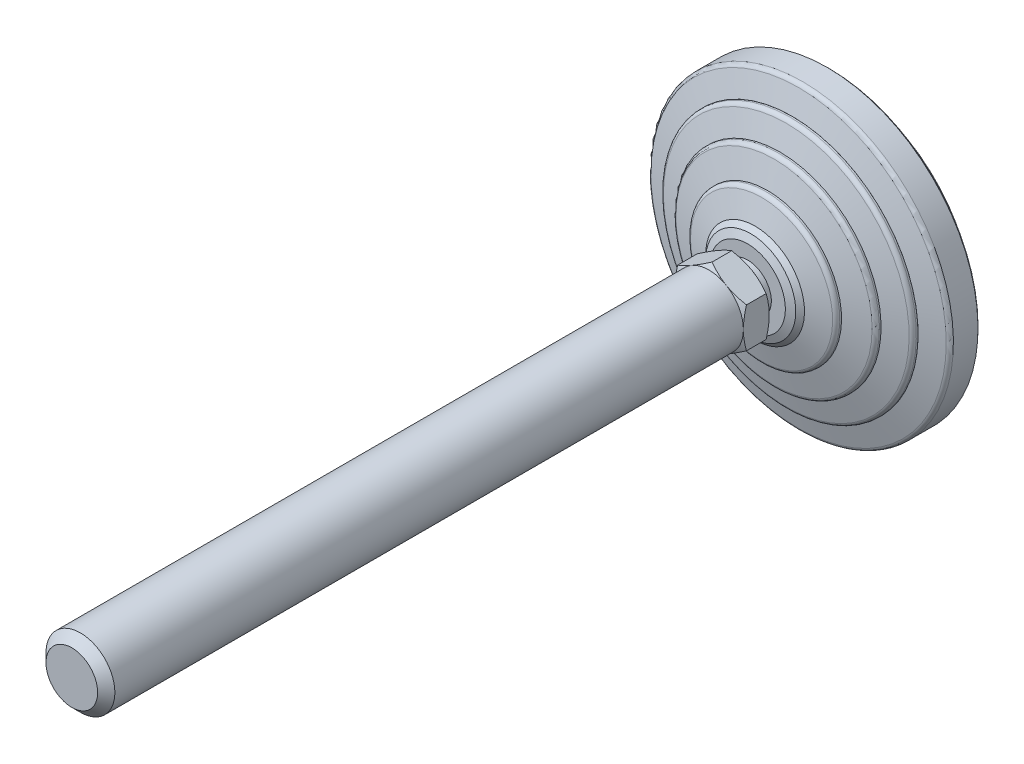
ISO-10303-21;
HEADER;
FILE_DESCRIPTION(('STEP AP214'),'2;1');
FILE_NAME('part.step','',(''),(''),'','','');
FILE_SCHEMA(('AUTOMOTIVE_DESIGN { 1 0 10303 214 1 1 1 1 }'));
ENDSEC;
DATA;
#1=APPLICATION_CONTEXT('core data for automotive mechanical design processes');
#2=APPLICATION_PROTOCOL_DEFINITION('international standard','automotive_design',2000,#1);
#3=PRODUCT_CONTEXT('',#1,'mechanical');
#4=PRODUCT('Part','Part','',(#3));
#5=PRODUCT_RELATED_PRODUCT_CATEGORY('part','',(#4));
#6=PRODUCT_DEFINITION_FORMATION('','',#4);
#7=PRODUCT_DEFINITION_CONTEXT('part definition',#1,'design');
#8=PRODUCT_DEFINITION('design','',#6,#7);
#9=PRODUCT_DEFINITION_SHAPE('','',#8);
#10=(LENGTH_UNIT() NAMED_UNIT(*) SI_UNIT(.MILLI.,.METRE.));
#11=(NAMED_UNIT(*) PLANE_ANGLE_UNIT() SI_UNIT($,.RADIAN.));
#12=(NAMED_UNIT(*) SI_UNIT($,.STERADIAN.) SOLID_ANGLE_UNIT());
#13=UNCERTAINTY_MEASURE_WITH_UNIT(LENGTH_MEASURE(1.E-05),#10,'distance_accuracy_value','');
#14=(GEOMETRIC_REPRESENTATION_CONTEXT(3) GLOBAL_UNCERTAINTY_ASSIGNED_CONTEXT((#13)) GLOBAL_UNIT_ASSIGNED_CONTEXT((#10,
#11,#12)) REPRESENTATION_CONTEXT('',''));
#15=CARTESIAN_POINT('',(0.,0.,0.));
#16=DIRECTION('',(0.,0.,1.));
#17=DIRECTION('',(1.,0.,0.));
#18=AXIS2_PLACEMENT_3D('',#15,#16,#17);
#19=CARTESIAN_POINT('',(-7.76470588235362,0.,24.9999999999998));
#20=DIRECTION('',(0.,0.,1.));
#21=DIRECTION('',(0.,-1.,0.));
#22=AXIS2_PLACEMENT_3D('',#19,#20,#21);
#23=PLANE('',#22);
#24=CARTESIAN_POINT('',(0.,0.,24.9999999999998));
#25=DIRECTION('',(0.,0.,-1.));
#26=DIRECTION('',(0.,1.,0.));
#27=AXIS2_PLACEMENT_3D('',#24,#25,#26);
#28=CIRCLE('',#27,5.5000000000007);
#29=CARTESIAN_POINT('',(0.,5.5000000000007,24.9999999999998));
#30=VERTEX_POINT('',#29);
#31=EDGE_CURVE('E345',#30,#30,#28,.T.);
#32=ORIENTED_EDGE('',*,*,#31,.F.);
#33=EDGE_LOOP('',(#32));
#34=FACE_BOUND('',#33,.T.);
#35=CARTESIAN_POINT('',(0.,0.,24.9999999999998));
#36=DIRECTION('',(0.,0.,-1.));
#37=DIRECTION('',(-1.,0.,0.));
#38=AXIS2_PLACEMENT_3D('',#35,#36,#37);
#39=CIRCLE('',#38,8.00000000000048);
#40=CARTESIAN_POINT('',(4.,6.92820323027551,24.9999999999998));
#41=VERTEX_POINT('',#40);
#42=CARTESIAN_POINT('',(8.,0.,24.9999999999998));
#43=VERTEX_POINT('',#42);
#44=EDGE_CURVE('E500',#41,#43,#39,.T.);
#45=ORIENTED_EDGE('',*,*,#44,.T.);
#46=CARTESIAN_POINT('',(4.,-6.92820323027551,24.9999999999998));
#47=VERTEX_POINT('',#46);
#48=EDGE_CURVE('E140',#43,#47,#39,.T.);
#49=ORIENTED_EDGE('',*,*,#48,.T.);
#50=CARTESIAN_POINT('',(-4.,-6.92820323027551,24.9999999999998));
#51=VERTEX_POINT('',#50);
#52=EDGE_CURVE('E139',#47,#51,#39,.T.);
#53=ORIENTED_EDGE('',*,*,#52,.T.);
#54=CARTESIAN_POINT('',(-8.,0.,24.9999999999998));
#55=VERTEX_POINT('',#54);
#56=EDGE_CURVE('E117',#51,#55,#39,.T.);
#57=ORIENTED_EDGE('',*,*,#56,.T.);
#58=CARTESIAN_POINT('',(-4.,6.92820323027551,24.9999999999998));
#59=VERTEX_POINT('',#58);
#60=EDGE_CURVE('E105',#55,#59,#39,.T.);
#61=ORIENTED_EDGE('',*,*,#60,.T.);
#62=EDGE_CURVE('E34',#59,#41,#39,.T.);
#63=ORIENTED_EDGE('',*,*,#62,.T.);
#64=EDGE_LOOP('',(#45,#49,#53,#57,#61,#63));
#65=FACE_BOUND('',#64,.T.);
#66=ADVANCED_FACE('F14',(#34,#65),#23,.F.);
#67=CARTESIAN_POINT('',(0.,0.,0.));
#68=DIRECTION('',(0.,0.,-1.));
#69=DIRECTION('',(0.,1.,0.));
#70=AXIS2_PLACEMENT_3D('',#67,#68,#69);
#71=CYLINDRICAL_SURFACE('',#70,5.5000000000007);
#72=CARTESIAN_POINT('',(0.,0.,22.));
#73=DIRECTION('',(0.,0.,-1.));
#74=DIRECTION('',(0.,1.,0.));
#75=AXIS2_PLACEMENT_3D('',#72,#73,#74);
#76=CIRCLE('',#75,5.5000000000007);
#77=CARTESIAN_POINT('',(0.,5.5000000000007,22.));
#78=VERTEX_POINT('',#77);
#79=EDGE_CURVE('E350',#78,#78,#76,.T.);
#80=ORIENTED_EDGE('',*,*,#79,.F.);
#81=EDGE_LOOP('',(#80));
#82=FACE_BOUND('',#81,.T.);
#83=ORIENTED_EDGE('',*,*,#31,.T.);
#84=EDGE_LOOP('',(#83));
#85=FACE_BOUND('',#84,.T.);
#86=ADVANCED_FACE('F313',(#82,#85),#71,.T.);
#87=CARTESIAN_POINT('',(-8.75409836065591,0.,22.));
#88=DIRECTION('',(0.,0.,-1.));
#89=DIRECTION('',(0.,1.,0.));
#90=AXIS2_PLACEMENT_3D('',#87,#88,#89);
#91=PLANE('',#90);
#92=CARTESIAN_POINT('',(0.,0.,22.));
#93=DIRECTION('',(0.,0.,-1.));
#94=DIRECTION('',(0.,1.,0.));
#95=AXIS2_PLACEMENT_3D('',#92,#93,#94);
#96=CIRCLE('',#95,8.75409836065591);
#97=CARTESIAN_POINT('',(0.,8.75409836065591,22.));
#98=VERTEX_POINT('',#97);
#99=EDGE_CURVE('E353',#98,#98,#96,.T.);
#100=ORIENTED_EDGE('',*,*,#99,.F.);
#101=EDGE_LOOP('',(#100));
#102=FACE_BOUND('',#101,.T.);
#103=ORIENTED_EDGE('',*,*,#79,.T.);
#104=EDGE_LOOP('',(#103));
#105=FACE_BOUND('',#104,.T.);
#106=ADVANCED_FACE('F309',(#102,#105),#91,.F.);
#107=CARTESIAN_POINT('',(0.,0.,22.));
#108=DIRECTION('',(0.,0.,-1.));
#109=DIRECTION('',(0.,1.,0.));
#110=AXIS2_PLACEMENT_3D('',#107,#108,#109);
#111=CONICAL_SURFACE('',#110,8.75409836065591,1.17809724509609);
#112=CARTESIAN_POINT('',(0.,0.,21.2928932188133));
#113=DIRECTION('',(0.,0.,-1.));
#114=DIRECTION('',(0.,1.,0.));
#115=AXIS2_PLACEMENT_3D('',#112,#113,#114);
#116=CIRCLE('',#115,10.4612051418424);
#117=CARTESIAN_POINT('',(0.,10.4612051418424,21.2928932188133));
#118=VERTEX_POINT('',#117);
#119=EDGE_CURVE('E356',#118,#118,#116,.T.);
#120=ORIENTED_EDGE('',*,*,#119,.F.);
#121=EDGE_LOOP('',(#120));
#122=FACE_BOUND('',#121,.T.);
#123=ORIENTED_EDGE('',*,*,#99,.T.);
#124=EDGE_LOOP('',(#123));
#125=FACE_BOUND('',#124,.T.);
#126=ADVANCED_FACE('F305',(#122,#125),#111,.T.);
#127=CARTESIAN_POINT('',(0.,0.,21.2928932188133));
#128=DIRECTION('',(0.,0.,-1.));
#129=DIRECTION('',(0.,1.,0.));
#130=AXIS2_PLACEMENT_3D('',#127,#128,#129);
#131=CONICAL_SURFACE('',#130,10.4612051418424,0.785398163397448);
#132=CARTESIAN_POINT('',(0.,0.,20.2786885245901));
#133=DIRECTION('',(0.,0.,-1.));
#134=DIRECTION('',(0.,1.,0.));
#135=AXIS2_PLACEMENT_3D('',#132,#133,#134);
#136=CIRCLE('',#135,11.4754098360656);
#137=CARTESIAN_POINT('',(0.,11.4754098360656,20.2786885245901));
#138=VERTEX_POINT('',#137);
#139=EDGE_CURVE('E359',#138,#138,#136,.T.);
#140=ORIENTED_EDGE('',*,*,#139,.F.);
#141=EDGE_LOOP('',(#140));
#142=FACE_BOUND('',#141,.T.);
#143=ORIENTED_EDGE('',*,*,#119,.T.);
#144=EDGE_LOOP('',(#143));
#145=FACE_BOUND('',#144,.T.);
#146=ADVANCED_FACE('F301',(#142,#145),#131,.T.);
#147=CARTESIAN_POINT('',(0.,0.,20.2786885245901));
#148=DIRECTION('',(0.,0.,-1.));
#149=DIRECTION('',(0.,1.,0.));
#150=AXIS2_PLACEMENT_3D('',#147,#148,#149);
#151=CONICAL_SURFACE('',#150,11.4754098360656,1.27933953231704);
#152=CARTESIAN_POINT('',(0.,0.,18.7711726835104));
#153=DIRECTION('',(0.,0.,-1.));
#154=DIRECTION('',(0.,1.,0.));
#155=AXIS2_PLACEMENT_3D('',#152,#153,#154);
#156=CIRCLE('',#155,16.5004626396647);
#157=CARTESIAN_POINT('',(0.,16.5004626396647,18.7711726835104));
#158=VERTEX_POINT('',#157);
#159=EDGE_CURVE('E362',#158,#158,#156,.T.);
#160=ORIENTED_EDGE('',*,*,#159,.F.);
#161=EDGE_LOOP('',(#160));
#162=FACE_BOUND('',#161,.T.);
#163=ORIENTED_EDGE('',*,*,#139,.T.);
#164=EDGE_LOOP('',(#163));
#165=FACE_BOUND('',#164,.T.);
#166=ADVANCED_FACE('F297',(#162,#165),#151,.T.);
#167=CARTESIAN_POINT('',(0.,0.,17.8133463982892));
#168=DIRECTION('',(0.,0.,-1.));
#169=DIRECTION('',(0.,1.,0.));
#170=AXIS2_PLACEMENT_3D('',#167,#168,#169);
#171=TOROIDAL_SURFACE('',#170,16.2131147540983,1.);
#172=CARTESIAN_POINT('',(0.,0.,17.8133463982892));
#173=DIRECTION('',(0.,0.,-1.));
#174=DIRECTION('',(0.,1.,0.));
#175=AXIS2_PLACEMENT_3D('',#172,#173,#174);
#176=CIRCLE('',#175,17.2131147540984);
#177=CARTESIAN_POINT('',(0.,17.2131147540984,17.8133463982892));
#178=VERTEX_POINT('',#177);
#179=EDGE_CURVE('E365',#178,#178,#176,.T.);
#180=ORIENTED_EDGE('',*,*,#179,.F.);
#181=EDGE_LOOP('',(#180));
#182=FACE_BOUND('',#181,.T.);
#183=ORIENTED_EDGE('',*,*,#159,.T.);
#184=EDGE_LOOP('',(#183));
#185=FACE_BOUND('',#184,.T.);
#186=ADVANCED_FACE('F293',(#182,#185),#171,.T.);
#187=CARTESIAN_POINT('',(0.,0.,0.));
#188=DIRECTION('',(0.,0.,-1.));
#189=DIRECTION('',(0.,1.,0.));
#190=AXIS2_PLACEMENT_3D('',#187,#188,#189);
#191=CYLINDRICAL_SURFACE('',#190,17.2131147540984);
#192=CARTESIAN_POINT('',(0.,0.,17.4098360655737));
#193=DIRECTION('',(0.,0.,-1.));
#194=DIRECTION('',(0.,1.,0.));
#195=AXIS2_PLACEMENT_3D('',#192,#193,#194);
#196=CIRCLE('',#195,17.2131147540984);
#197=CARTESIAN_POINT('',(0.,17.2131147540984,17.4098360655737));
#198=VERTEX_POINT('',#197);
#199=EDGE_CURVE('E368',#198,#198,#196,.T.);
#200=ORIENTED_EDGE('',*,*,#199,.F.);
#201=EDGE_LOOP('',(#200));
#202=FACE_BOUND('',#201,.T.);
#203=ORIENTED_EDGE('',*,*,#179,.T.);
#204=EDGE_LOOP('',(#203));
#205=FACE_BOUND('',#204,.T.);
#206=ADVANCED_FACE('F289',(#202,#205),#191,.T.);
#207=CARTESIAN_POINT('',(0.,0.,17.4098360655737));
#208=DIRECTION('',(0.,0.,-1.));
#209=DIRECTION('',(0.,1.,0.));
#210=AXIS2_PLACEMENT_3D('',#207,#208,#209);
#211=CONICAL_SURFACE('',#210,17.2131147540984,1.30454427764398);
#212=CARTESIAN_POINT('',(0.,0.,15.8894925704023));
#213=DIRECTION('',(0.,0.,-1.));
#214=DIRECTION('',(0.,1.,0.));
#215=AXIS2_PLACEMENT_3D('',#212,#213,#214);
#216=CIRCLE('',#215,22.7877075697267);
#217=CARTESIAN_POINT('',(0.,22.7877075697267,15.8894925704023));
#218=VERTEX_POINT('',#217);
#219=EDGE_CURVE('E371',#218,#218,#216,.T.);
#220=ORIENTED_EDGE('',*,*,#219,.F.);
#221=EDGE_LOOP('',(#220));
#222=FACE_BOUND('',#221,.T.);
#223=ORIENTED_EDGE('',*,*,#199,.T.);
#224=EDGE_LOOP('',(#223));
#225=FACE_BOUND('',#224,.T.);
#226=ADVANCED_FACE('F285',(#222,#225),#211,.T.);
#227=CARTESIAN_POINT('',(0.,0.,14.9247287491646));
#228=DIRECTION('',(0.,0.,-1.));
#229=DIRECTION('',(0.,1.,0.));
#230=AXIS2_PLACEMENT_3D('',#227,#228,#229);
#231=TOROIDAL_SURFACE('',#230,22.5245901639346,1.);
#232=CARTESIAN_POINT('',(0.,0.,14.9247287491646));
#233=DIRECTION('',(0.,0.,-1.));
#234=DIRECTION('',(0.,1.,0.));
#235=AXIS2_PLACEMENT_3D('',#232,#233,#234);
#236=CIRCLE('',#235,23.5245901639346);
#237=CARTESIAN_POINT('',(0.,23.5245901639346,14.9247287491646));
#238=VERTEX_POINT('',#237);
#239=EDGE_CURVE('E374',#238,#238,#236,.T.);
#240=ORIENTED_EDGE('',*,*,#239,.F.);
#241=EDGE_LOOP('',(#240));
#242=FACE_BOUND('',#241,.T.);
#243=ORIENTED_EDGE('',*,*,#219,.T.);
#244=EDGE_LOOP('',(#243));
#245=FACE_BOUND('',#244,.T.);
#246=ADVANCED_FACE('F281',(#242,#245),#231,.T.);
#247=CARTESIAN_POINT('',(0.,0.,0.));
#248=DIRECTION('',(0.,0.,-1.));
#249=DIRECTION('',(0.,1.,0.));
#250=AXIS2_PLACEMENT_3D('',#247,#248,#249);
#251=CYLINDRICAL_SURFACE('',#250,23.5245901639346);
#252=CARTESIAN_POINT('',(0.,0.,14.5409836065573));
#253=DIRECTION('',(0.,0.,-1.));
#254=DIRECTION('',(0.,1.,0.));
#255=AXIS2_PLACEMENT_3D('',#252,#253,#254);
#256=CIRCLE('',#255,23.5245901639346);
#257=CARTESIAN_POINT('',(0.,23.5245901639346,14.5409836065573));
#258=VERTEX_POINT('',#257);
#259=EDGE_CURVE('E377',#258,#258,#256,.T.);
#260=ORIENTED_EDGE('',*,*,#259,.F.);
#261=EDGE_LOOP('',(#260));
#262=FACE_BOUND('',#261,.T.);
#263=ORIENTED_EDGE('',*,*,#239,.T.);
#264=EDGE_LOOP('',(#263));
#265=FACE_BOUND('',#264,.T.);
#266=ADVANCED_FACE('F277',(#262,#265),#251,.T.);
#267=CARTESIAN_POINT('',(0.,0.,14.5409836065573));
#268=DIRECTION('',(0.,0.,-1.));
#269=DIRECTION('',(0.,1.,0.));
#270=AXIS2_PLACEMENT_3D('',#267,#268,#269);
#271=CONICAL_SURFACE('',#270,23.5245901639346,1.27871257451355);
#272=CARTESIAN_POINT('',(0.,0.,13.0337743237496));
#273=DIRECTION('',(0.,0.,-1.));
#274=DIRECTION('',(0.,1.,0.));
#275=AXIS2_PLACEMENT_3D('',#272,#273,#274);
#276=CIRCLE('',#275,28.5372004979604);
#277=CARTESIAN_POINT('',(0.,28.5372004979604,13.0337743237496));
#278=VERTEX_POINT('',#277);
#279=EDGE_CURVE('E380',#278,#278,#276,.T.);
#280=ORIENTED_EDGE('',*,*,#279,.F.);
#281=EDGE_LOOP('',(#280));
#282=FACE_BOUND('',#281,.T.);
#283=ORIENTED_EDGE('',*,*,#259,.T.);
#284=EDGE_LOOP('',(#283));
#285=FACE_BOUND('',#284,.T.);
#286=ADVANCED_FACE('F273',(#282,#285),#271,.T.);
#287=CARTESIAN_POINT('',(0.,0.,12.0761283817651));
#288=DIRECTION('',(0.,0.,-1.));
#289=DIRECTION('',(0.,1.,0.));
#290=AXIS2_PLACEMENT_3D('',#287,#288,#289);
#291=TOROIDAL_SURFACE('',#290,28.2492521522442,1.);
#292=CARTESIAN_POINT('',(0.,0.,12.0761283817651));
#293=DIRECTION('',(0.,0.,-1.));
#294=DIRECTION('',(0.,1.,0.));
#295=AXIS2_PLACEMENT_3D('',#292,#293,#294);
#296=CIRCLE('',#295,29.2492521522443);
#297=CARTESIAN_POINT('',(0.,29.2492521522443,12.0761283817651));
#298=VERTEX_POINT('',#297);
#299=EDGE_CURVE('E383',#298,#298,#296,.T.);
#300=ORIENTED_EDGE('',*,*,#299,.F.);
#301=EDGE_LOOP('',(#300));
#302=FACE_BOUND('',#301,.T.);
#303=ORIENTED_EDGE('',*,*,#279,.T.);
#304=EDGE_LOOP('',(#303));
#305=FACE_BOUND('',#304,.T.);
#306=ADVANCED_FACE('F269',(#302,#305),#291,.T.);
#307=CARTESIAN_POINT('',(0.,0.,0.));
#308=DIRECTION('',(0.,0.,-1.));
#309=DIRECTION('',(0.,1.,0.));
#310=AXIS2_PLACEMENT_3D('',#307,#308,#309);
#311=CYLINDRICAL_SURFACE('',#310,29.2492521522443);
#312=CARTESIAN_POINT('',(0.,0.,11.672131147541));
#313=DIRECTION('',(0.,0.,-1.));
#314=DIRECTION('',(0.,1.,0.));
#315=AXIS2_PLACEMENT_3D('',#312,#313,#314);
#316=CIRCLE('',#315,29.2492521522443);
#317=CARTESIAN_POINT('',(0.,29.2492521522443,11.672131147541));
#318=VERTEX_POINT('',#317);
#319=EDGE_CURVE('E386',#318,#318,#316,.T.);
#320=ORIENTED_EDGE('',*,*,#319,.F.);
#321=EDGE_LOOP('',(#320));
#322=FACE_BOUND('',#321,.T.);
#323=ORIENTED_EDGE('',*,*,#299,.T.);
#324=EDGE_LOOP('',(#323));
#325=FACE_BOUND('',#324,.T.);
#326=ADVANCED_FACE('F265',(#322,#325),#311,.T.);
#327=CARTESIAN_POINT('',(-29.2622950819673,0.,11.672131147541));
#328=DIRECTION('',(0.,0.,-1.));
#329=DIRECTION('',(0.,1.,0.));
#330=AXIS2_PLACEMENT_3D('',#327,#328,#329);
#331=PLANE('',#330);
#332=CARTESIAN_POINT('',(0.,0.,11.672131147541));
#333=DIRECTION('',(0.,0.,-1.));
#334=DIRECTION('',(0.,1.,0.));
#335=AXIS2_PLACEMENT_3D('',#332,#333,#334);
#336=CIRCLE('',#335,29.2622950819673);
#337=CARTESIAN_POINT('',(0.,29.2622950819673,11.672131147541));
#338=VERTEX_POINT('',#337);
#339=EDGE_CURVE('E389',#338,#338,#336,.T.);
#340=ORIENTED_EDGE('',*,*,#339,.F.);
#341=EDGE_LOOP('',(#340));
#342=FACE_BOUND('',#341,.T.);
#343=ORIENTED_EDGE('',*,*,#319,.T.);
#344=EDGE_LOOP('',(#343));
#345=FACE_BOUND('',#344,.T.);
#346=ADVANCED_FACE('F261',(#342,#345),#331,.F.);
#347=CARTESIAN_POINT('',(0.,0.,11.672131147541));
#348=DIRECTION('',(0.,0.,-1.));
#349=DIRECTION('',(0.,1.,0.));
#350=AXIS2_PLACEMENT_3D('',#347,#348,#349);
#351=CONICAL_SURFACE('',#350,29.2622950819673,1.27933953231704);
#352=CARTESIAN_POINT('',(0.,0.,10.1646153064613));
#353=DIRECTION('',(0.,0.,-1.));
#354=DIRECTION('',(0.,1.,0.));
#355=AXIS2_PLACEMENT_3D('',#352,#353,#354);
#356=CIRCLE('',#355,34.2873478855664);
#357=CARTESIAN_POINT('',(0.,34.2873478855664,10.1646153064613));
#358=VERTEX_POINT('',#357);
#359=EDGE_CURVE('E392',#358,#358,#356,.T.);
#360=ORIENTED_EDGE('',*,*,#359,.F.);
#361=EDGE_LOOP('',(#360));
#362=FACE_BOUND('',#361,.T.);
#363=ORIENTED_EDGE('',*,*,#339,.T.);
#364=EDGE_LOOP('',(#363));
#365=FACE_BOUND('',#364,.T.);
#366=ADVANCED_FACE('F257',(#362,#365),#351,.T.);
#367=CARTESIAN_POINT('',(0.,0.,9.20678902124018));
#368=DIRECTION('',(0.,0.,-1.));
#369=DIRECTION('',(0.,1.,0.));
#370=AXIS2_PLACEMENT_3D('',#367,#368,#369);
#371=TOROIDAL_SURFACE('',#370,34.,1.);
#372=CARTESIAN_POINT('',(0.,0.,9.20678902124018));
#373=DIRECTION('',(0.,0.,-1.));
#374=DIRECTION('',(0.,1.,0.));
#375=AXIS2_PLACEMENT_3D('',#372,#373,#374);
#376=CIRCLE('',#375,35.);
#377=CARTESIAN_POINT('',(0.,35.,9.20678902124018));
#378=VERTEX_POINT('',#377);
#379=EDGE_CURVE('E395',#378,#378,#376,.T.);
#380=ORIENTED_EDGE('',*,*,#379,.F.);
#381=EDGE_LOOP('',(#380));
#382=FACE_BOUND('',#381,.T.);
#383=ORIENTED_EDGE('',*,*,#359,.T.);
#384=EDGE_LOOP('',(#383));
#385=FACE_BOUND('',#384,.T.);
#386=ADVANCED_FACE('F253',(#382,#385),#371,.T.);
#387=CARTESIAN_POINT('',(0.,0.,0.));
#388=DIRECTION('',(0.,0.,-1.));
#389=DIRECTION('',(0.,1.,0.));
#390=AXIS2_PLACEMENT_3D('',#387,#388,#389);
#391=CYLINDRICAL_SURFACE('',#390,35.);
#392=CARTESIAN_POINT('',(0.,0.,3.5));
#393=DIRECTION('',(0.,0.,-1.));
#394=DIRECTION('',(0.,1.,0.));
#395=AXIS2_PLACEMENT_3D('',#392,#393,#394);
#396=CIRCLE('',#395,35.);
#397=CARTESIAN_POINT('',(0.,35.,3.5));
#398=VERTEX_POINT('',#397);
#399=EDGE_CURVE('E398',#398,#398,#396,.T.);
#400=ORIENTED_EDGE('',*,*,#399,.F.);
#401=EDGE_LOOP('',(#400));
#402=FACE_BOUND('',#401,.T.);
#403=ORIENTED_EDGE('',*,*,#379,.T.);
#404=EDGE_LOOP('',(#403));
#405=FACE_BOUND('',#404,.T.);
#406=ADVANCED_FACE('F249',(#402,#405),#391,.T.);
#407=CARTESIAN_POINT('',(0.,0.,3.5));
#408=DIRECTION('',(0.,0.,1.));
#409=DIRECTION('',(0.,-1.,0.));
#410=AXIS2_PLACEMENT_3D('',#407,#408,#409);
#411=CONICAL_SURFACE('',#410,35.,0.785398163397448);
#412=CARTESIAN_POINT('',(0.,0.,3.));
#413=DIRECTION('',(0.,0.,-1.));
#414=DIRECTION('',(0.,1.,0.));
#415=AXIS2_PLACEMENT_3D('',#412,#413,#414);
#416=CIRCLE('',#415,34.5);
#417=CARTESIAN_POINT('',(0.,34.5,3.));
#418=VERTEX_POINT('',#417);
#419=EDGE_CURVE('E401',#418,#418,#416,.T.);
#420=ORIENTED_EDGE('',*,*,#419,.F.);
#421=EDGE_LOOP('',(#420));
#422=FACE_BOUND('',#421,.T.);
#423=ORIENTED_EDGE('',*,*,#399,.T.);
#424=EDGE_LOOP('',(#423));
#425=FACE_BOUND('',#424,.T.);
#426=ADVANCED_FACE('F245',(#422,#425),#411,.T.);
#427=CARTESIAN_POINT('',(-34.5,0.,3.));
#428=DIRECTION('',(0.,0.,1.));
#429=DIRECTION('',(0.,-1.,0.));
#430=AXIS2_PLACEMENT_3D('',#427,#428,#429);
#431=PLANE('',#430);
#432=CARTESIAN_POINT('',(0.,0.,3.));
#433=DIRECTION('',(0.,0.,-1.));
#434=DIRECTION('',(0.,1.,0.));
#435=AXIS2_PLACEMENT_3D('',#432,#433,#434);
#436=CIRCLE('',#435,30.4098360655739);
#437=CARTESIAN_POINT('',(0.,30.4098360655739,3.));
#438=VERTEX_POINT('',#437);
#439=EDGE_CURVE('E404',#438,#438,#436,.T.);
#440=ORIENTED_EDGE('',*,*,#439,.F.);
#441=EDGE_LOOP('',(#440));
#442=FACE_BOUND('',#441,.T.);
#443=ORIENTED_EDGE('',*,*,#419,.T.);
#444=EDGE_LOOP('',(#443));
#445=FACE_BOUND('',#444,.T.);
#446=ADVANCED_FACE('F241',(#442,#445),#431,.F.);
#447=CARTESIAN_POINT('',(0.,0.,0.));
#448=DIRECTION('',(0.,0.,-1.));
#449=DIRECTION('',(0.,1.,0.));
#450=AXIS2_PLACEMENT_3D('',#447,#448,#449);
#451=CYLINDRICAL_SURFACE('',#450,30.4098360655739);
#452=CARTESIAN_POINT('',(0.,0.,0.));
#453=DIRECTION('',(0.,0.,-1.));
#454=DIRECTION('',(0.,1.,0.));
#455=AXIS2_PLACEMENT_3D('',#452,#453,#454);
#456=CIRCLE('',#455,30.4098360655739);
#457=CARTESIAN_POINT('',(0.,30.4098360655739,0.));
#458=VERTEX_POINT('',#457);
#459=EDGE_CURVE('E407',#458,#458,#456,.T.);
#460=ORIENTED_EDGE('',*,*,#459,.F.);
#461=EDGE_LOOP('',(#460));
#462=FACE_BOUND('',#461,.T.);
#463=ORIENTED_EDGE('',*,*,#439,.T.);
#464=EDGE_LOOP('',(#463));
#465=FACE_BOUND('',#464,.T.);
#466=ADVANCED_FACE('F237',(#462,#465),#451,.T.);
#467=CARTESIAN_POINT('',(-30.4098360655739,0.,0.));
#468=DIRECTION('',(0.,0.,1.));
#469=DIRECTION('',(0.,-1.,0.));
#470=AXIS2_PLACEMENT_3D('',#467,#468,#469);
#471=PLANE('',#470);
#472=ORIENTED_EDGE('',*,*,#459,.T.);
#473=EDGE_LOOP('',(#472));
#474=FACE_BOUND('',#473,.T.);
#475=ADVANCED_FACE('F233',(#474),#471,.F.);
#476=CARTESIAN_POINT('',(0.,0.,26.586010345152));
#477=DIRECTION('',(0.,0.,1.));
#478=DIRECTION('',(1.,0.,0.));
#479=AXIS2_PLACEMENT_3D('',#476,#477,#478);
#480=CONICAL_SURFACE('',#479,10.747050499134,1.0471975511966);
#481=CARTESIAN_POINT('',(8.,-12.3710335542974,28.8869306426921));
#482=CARTESIAN_POINT('',(8.,-12.021924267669,28.7177249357));
#483=CARTESIAN_POINT('',(8.,-11.672009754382,28.5501519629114));
#484=CARTESIAN_POINT('',(8.,-10.9701419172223,28.2191904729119));
#485=CARTESIAN_POINT('',(8.,-10.6181882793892,28.055802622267));
#486=CARTESIAN_POINT('',(8.,-9.90998324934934,27.7333006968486));
#487=CARTESIAN_POINT('',(8.,-9.55371886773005,27.5742150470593));
#488=CARTESIAN_POINT('',(8.,-8.83834412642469,27.2626016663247));
#489=CARTESIAN_POINT('',(8.,-8.47923390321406,27.1100736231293));
#490=CARTESIAN_POINT('',(8.,-7.74613020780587,26.8085927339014));
#491=CARTESIAN_POINT('',(8.,-7.37202620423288,26.6599071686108));
#492=CARTESIAN_POINT('',(8.,-6.61942915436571,26.3738756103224));
#493=CARTESIAN_POINT('',(8.,-6.2409356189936,26.2365308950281));
#494=CARTESIAN_POINT('',(8.,-5.479672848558,25.976813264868));
#495=CARTESIAN_POINT('',(8.,-5.09691417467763,25.8544097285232));
#496=CARTESIAN_POINT('',(8.,-4.32592037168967,25.6285240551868));
#497=CARTESIAN_POINT('',(8.,-3.93768702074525,25.5250359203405));
#498=CARTESIAN_POINT('',(8.,-3.15761354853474,25.3425281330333));
#499=CARTESIAN_POINT('',(8.,-2.76580511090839,25.2633767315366));
#500=CARTESIAN_POINT('',(8.,-2.17455312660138,25.1663451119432));
#501=CARTESIAN_POINT('',(8.,-1.97686441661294,25.137615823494));
#502=CARTESIAN_POINT('',(8.,-1.58051654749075,25.0879533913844));
#503=CARTESIAN_POINT('',(8.,-1.38185748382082,25.0670194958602));
#504=CARTESIAN_POINT('',(8.,-0.986414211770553,25.0336255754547));
#505=CARTESIAN_POINT('',(8.,-0.78963900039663,25.0210594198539));
#506=CARTESIAN_POINT('',(8.,-0.395733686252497,25.0042571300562));
#507=CARTESIAN_POINT('',(8.,-0.198603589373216,25.0000208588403));
#508=CARTESIAN_POINT('',(8.,0.195659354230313,24.9999792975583));
#509=CARTESIAN_POINT('',(8.,0.3927922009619,25.0041740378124));
#510=CARTESIAN_POINT('',(8.,0.786706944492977,25.0208925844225));
#511=CARTESIAN_POINT('',(8.,0.983488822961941,25.0334168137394));
#512=CARTESIAN_POINT('',(8.,1.45751327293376,25.0733550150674));
#513=CARTESIAN_POINT('',(8.,1.73442475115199,25.1047820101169));
#514=CARTESIAN_POINT('',(8.,2.28615584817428,25.1824070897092));
#515=CARTESIAN_POINT('',(8.,2.56097517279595,25.2286072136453));
#516=CARTESIAN_POINT('',(8.,3.38200219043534,25.3869143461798));
#517=CARTESIAN_POINT('',(8.,3.92446404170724,25.5186981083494));
#518=CARTESIAN_POINT('',(8.,4.73551669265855,25.746757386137));
#519=CARTESIAN_POINT('',(8.,5.00832649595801,25.8288878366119));
#520=CARTESIAN_POINT('',(8.,5.5512957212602,26.0015643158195));
#521=CARTESIAN_POINT('',(8.,5.82145512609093,26.0921103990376));
#522=CARTESIAN_POINT('',(8.,6.35921050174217,26.2801749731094));
#523=CARTESIAN_POINT('',(8.,6.62680731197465,26.3776910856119));
#524=CARTESIAN_POINT('',(8.,7.15979186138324,26.5785598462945));
#525=CARTESIAN_POINT('',(8.,7.42517962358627,26.681912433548));
#526=CARTESIAN_POINT('',(8.,8.0395200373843,26.9277020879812));
#527=CARTESIAN_POINT('',(8.,8.38773912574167,27.071968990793));
#528=CARTESIAN_POINT('',(8.,9.0813072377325,27.3672633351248));
#529=CARTESIAN_POINT('',(8.,9.42665610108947,27.518291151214));
#530=CARTESIAN_POINT('',(8.,10.1149952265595,27.8257841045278));
#531=CARTESIAN_POINT('',(8.,10.4579850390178,27.9822502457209));
#532=CARTESIAN_POINT('',(8.,11.141937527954,28.2995596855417));
#533=CARTESIAN_POINT('',(8.,11.4829001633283,28.4604030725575));
#534=CARTESIAN_POINT('',(8.,12.1634570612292,28.7858252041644));
#535=CARTESIAN_POINT('',(8.,12.5030496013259,28.9504075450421));
#536=CARTESIAN_POINT('',(8.,13.1807867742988,29.2825295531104));
#537=CARTESIAN_POINT('',(8.,13.5189313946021,29.4500692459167));
#538=CARTESIAN_POINT('',(8.,14.531448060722,29.9563137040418));
#539=CARTESIAN_POINT('',(8.,15.2039870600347,30.2986844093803));
#540=CARTESIAN_POINT('',(8.,16.4911575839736,30.9623414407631));
#541=CARTESIAN_POINT('',(8.,17.1060677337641,31.2830897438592));
#542=CARTESIAN_POINT('',(8.,18.3335801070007,31.9290174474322));
#543=CARTESIAN_POINT('',(8.,18.9461822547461,32.2541969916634));
#544=CARTESIAN_POINT('',(8.,20.168128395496,32.9071692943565));
#545=CARTESIAN_POINT('',(8.,20.7774766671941,33.2349540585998));
#546=CARTESIAN_POINT('',(8.,21.9946900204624,33.8931911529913));
#547=CARTESIAN_POINT('',(8.,22.6025551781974,34.2236433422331));
#548=CARTESIAN_POINT('',(8.,23.2098709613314,34.5550953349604));
#549=B_SPLINE_CURVE_WITH_KNOTS('',3,(#481,#482,#483,#484,#485,#486,#487,#488,#489,#490,#491,
#492,#493,#494,#495,#496,#497,#498,#499,#500,#501,#502,#503,#504,#505,#506,#507,#508,#509,#510,
#511,#512,#513,#514,#515,#516,#517,#518,#519,#520,#521,#522,#523,#524,#525,#526,#527,#528,#529,
#530,#531,#532,#533,#534,#535,#536,#537,#538,#539,#540,#541,#542,#543,#544,#545,#546,#547,#548),
.UNSPECIFIED.,.F.,.F.,(4,2,2,2,2,2,2,2,2,2,2,2,2,2,2,2,2,2,2,2,2,2,2,2,2,2,2,2,2,2,2,2,2,4),(0.,
1.16387467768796,2.32793358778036,3.49839036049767,4.66879133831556,5.87635346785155,
7.08405146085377,8.28923120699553,9.49402813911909,10.6921830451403,11.2913495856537,
11.8904583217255,12.481815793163,13.073163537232,13.6645134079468,14.2558933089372,
15.0914876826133,15.9271974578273,17.5995616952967,18.4542055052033,19.3088548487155,
20.1632139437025,21.0175641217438,22.1482323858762,23.2789633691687,24.409904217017,
25.5408679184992,26.6729697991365,27.8050814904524,30.0690246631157,32.1496171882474,
34.2302773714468,36.3060192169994,38.3816521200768),.UNSPECIFIED.);
#550=CARTESIAN_POINT('',(8.,4.61880215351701,25.7145311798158));
#551=VERTEX_POINT('',#550);
#552=EDGE_CURVE('E115',#551,#43,#549,.F.);
#553=ORIENTED_EDGE('',*,*,#552,.T.);
#554=ORIENTED_EDGE('',*,*,#44,.F.);
#555=CARTESIAN_POINT('',(-1.08078911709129,9.86159819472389,26.1088856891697));
#556=CARTESIAN_POINT('',(-0.88402194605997,9.74799461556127,26.0313291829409));
#557=CARTESIAN_POINT('',(-0.686466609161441,9.63393598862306,25.9563558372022));
#558=CARTESIAN_POINT('',(-0.289620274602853,9.40481665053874,25.8125053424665));
#559=CARTESIAN_POINT('',(-0.0903286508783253,9.28975557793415,25.7436305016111));
#560=CARTESIAN_POINT('',(0.31083620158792,9.05814294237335,25.6126943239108));
#561=CARTESIAN_POINT('',(0.512716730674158,8.94158716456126,25.5506626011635));
#562=CARTESIAN_POINT('',(0.918234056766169,8.70746162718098,25.434853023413));
#563=CARTESIAN_POINT('',(1.12187066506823,8.58989197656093,25.3810742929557));
#564=CARTESIAN_POINT('',(1.52451335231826,8.35742611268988,25.2844335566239));
#565=CARTESIAN_POINT('',(1.7234675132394,8.24255987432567,25.2412850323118));
#566=CARTESIAN_POINT('',(2.12278774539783,8.01201223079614,25.1648442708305));
#567=CARTESIAN_POINT('',(2.3231537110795,7.89633088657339,25.1315513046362));
#568=CARTESIAN_POINT('',(2.72463932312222,7.66453306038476,25.0757848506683));
#569=CARTESIAN_POINT('',(2.92575684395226,7.54841780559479,25.0532911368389));
#570=CARTESIAN_POINT('',(3.32870682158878,7.31577452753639,25.0197173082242));
#571=CARTESIAN_POINT('',(3.53053925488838,7.19924651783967,25.0086368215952));
#572=CARTESIAN_POINT('',(3.9222317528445,6.97310274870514,24.9985607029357));
#573=CARTESIAN_POINT('',(4.11207863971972,6.86349459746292,24.9988755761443));
#574=CARTESIAN_POINT('',(4.49154530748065,6.64440941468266,25.0098854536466));
#575=CARTESIAN_POINT('',(4.68116508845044,6.53493238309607,25.0205804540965));
#576=CARTESIAN_POINT('',(5.06007686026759,6.31616756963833,25.0520705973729));
#577=CARTESIAN_POINT('',(5.24936782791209,6.20688037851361,25.0728820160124));
#578=CARTESIAN_POINT('',(5.62696938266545,5.98887201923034,25.1240440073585));
#579=CARTESIAN_POINT('',(5.81527998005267,5.88015084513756,25.1543944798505));
#580=CARTESIAN_POINT('',(6.38943353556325,5.54866313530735,25.2607106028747));
#581=CARTESIAN_POINT('',(6.77328762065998,5.32704487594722,25.3509462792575));
#582=CARTESIAN_POINT('',(7.53368603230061,4.88802864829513,25.5609522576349));
#583=CARTESIAN_POINT('',(7.91024949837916,4.6706196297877,25.6806291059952));
#584=CARTESIAN_POINT('',(8.28332296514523,4.4552255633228,25.8114364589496));
#585=B_SPLINE_CURVE_WITH_KNOTS('',3,(#555,#556,#557,#558,#559,#560,#561,#562,#563,#564,#565,
#566,#567,#568,#569,#570,#571,#572,#573,#574,#575,#576,#577,#578,#579,#580,#581,#582,#583,#584),
.UNSPECIFIED.,.F.,.F.,(4,2,2,2,2,2,2,2,2,2,2,2,2,2,4),(0.,0.720262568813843,1.44079658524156,
2.16433563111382,2.88779787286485,3.58885364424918,4.28985754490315,4.98954335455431,
5.68920636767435,6.34661019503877,7.00401377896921,7.66247854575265,8.32093639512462,
9.67666475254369,11.0281439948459),.UNSPECIFIED.);
#586=EDGE_CURVE('E18',#41,#551,#585,.T.);
#587=ORIENTED_EDGE('',*,*,#586,.T.);
#588=EDGE_LOOP('',(#553,#554,#587));
#589=FACE_BOUND('',#588,.T.);
#590=ADVANCED_FACE('F157',(#589),#480,.T.);
#591=CARTESIAN_POINT('',(-14.4917082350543,0.870812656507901,28.7630815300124));
#592=CARTESIAN_POINT('',(-14.1855323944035,1.04758336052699,28.5928031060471));
#593=CARTESIAN_POINT('',(-13.878612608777,1.22478358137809,28.4242743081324));
#594=CARTESIAN_POINT('',(-13.262876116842,1.58027921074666,28.0917324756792));
#595=CARTESIAN_POINT('',(-12.9540590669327,1.75857481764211,27.927720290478));
#596=CARTESIAN_POINT('',(-12.3322999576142,2.11754760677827,27.6042869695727));
#597=CARTESIAN_POINT('',(-12.0193441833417,2.2982327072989,27.4449008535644));
#598=CARTESIAN_POINT('',(-11.3907779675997,2.66113558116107,27.1332968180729));
#599=CARTESIAN_POINT('',(-11.0751676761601,2.84335326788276,26.9810784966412));
#600=CARTESIAN_POINT('',(-10.4377709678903,3.21135442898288,26.6843660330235));
#601=CARTESIAN_POINT('',(-10.115954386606,3.39715531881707,26.5399577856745));
#602=CARTESIAN_POINT('',(-9.4684228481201,3.77100782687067,26.2630690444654));
#603=CARTESIAN_POINT('',(-9.14270743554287,3.95905970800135,26.130589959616));
#604=CARTESIAN_POINT('',(-8.48760401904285,4.33728384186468,25.8813567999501));
#605=CARTESIAN_POINT('',(-8.15822660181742,4.52744998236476,25.7645660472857));
#606=CARTESIAN_POINT('',(-7.49476036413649,4.91050239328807,25.5507272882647));
#607=CARTESIAN_POINT('',(-7.16067319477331,5.10338771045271,25.4536725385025));
#608=CARTESIAN_POINT('',(-6.49160088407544,5.48967678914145,25.285322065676));
#609=CARTESIAN_POINT('',(-6.15667132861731,5.68304845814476,25.2137400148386));
#610=CARTESIAN_POINT('',(-5.65151256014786,5.9747020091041,25.1281684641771));
#611=CARTESIAN_POINT('',(-5.48264347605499,6.07219862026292,25.1032763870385));
#612=CARTESIAN_POINT('',(-5.14418791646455,6.26760602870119,25.0612524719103));
#613=CARTESIAN_POINT('',(-4.97460150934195,6.36551678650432,25.0441199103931));
#614=CARTESIAN_POINT('',(-4.63591129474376,6.56105967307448,25.0180667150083));
#615=CARTESIAN_POINT('',(-4.4668101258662,6.65869027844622,25.0091005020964));
#616=CARTESIAN_POINT('',(-4.12843169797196,6.85405315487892,24.9994190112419));
#617=CARTESIAN_POINT('',(-3.95915444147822,6.95178542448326,24.9987036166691));
#618=CARTESIAN_POINT('',(-3.62076804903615,7.1471528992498,25.0055404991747));
#619=CARTESIAN_POINT('',(-3.45165888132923,7.24478812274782,25.0130906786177));
#620=CARTESIAN_POINT('',(-3.11385434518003,7.43981966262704,25.0362792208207));
#621=CARTESIAN_POINT('',(-2.94515900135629,7.53721596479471,25.0519180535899));
#622=CARTESIAN_POINT('',(-2.52950796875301,7.77719220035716,25.1001008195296));
#623=CARTESIAN_POINT('',(-2.28293550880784,7.91955087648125,25.1371327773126));
#624=CARTESIAN_POINT('',(-1.79186551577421,8.20307026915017,25.2263551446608));
#625=CARTESIAN_POINT('',(-1.54736832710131,8.34423078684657,25.2785480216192));
#626=CARTESIAN_POINT('',(-0.816491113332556,8.76620294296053,25.4552303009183));
#627=CARTESIAN_POINT('',(-0.333698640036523,9.04494330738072,25.5996966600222));
#628=CARTESIAN_POINT('',(0.388097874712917,9.46167271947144,25.8467078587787));
#629=CARTESIAN_POINT('',(0.630913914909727,9.60186262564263,25.9352270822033));
#630=CARTESIAN_POINT('',(1.1142012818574,9.88088871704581,26.1205741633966));
#631=CARTESIAN_POINT('',(1.35467240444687,10.0197247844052,26.2174027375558));
#632=CARTESIAN_POINT('',(1.83206399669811,10.2953469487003,26.4173337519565));
#633=CARTESIAN_POINT('',(2.06899693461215,10.4321402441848,26.5203968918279));
#634=CARTESIAN_POINT('',(2.54088049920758,10.7045823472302,26.7321550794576));
#635=CARTESIAN_POINT('',(2.77583175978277,10.8402315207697,26.8408482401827));
#636=CARTESIAN_POINT('',(3.00995404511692,10.9754020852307,26.9518212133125));
#637=B_SPLINE_CURVE_WITH_KNOTS('',3,(#591,#592,#593,#594,#595,#596,#597,#598,#599,#600,#601,
#602,#603,#604,#605,#606,#607,#608,#609,#610,#611,#612,#613,#614,#615,#616,#617,#618,#619,#620,
#621,#622,#623,#624,#625,#626,#627,#628,#629,#630,#631,#632,#633,#634,#635,#636),.UNSPECIFIED.,
.F.,.F.,(4,2,2,2,2,2,2,2,2,2,2,2,2,2,2,2,2,2,2,2,2,2,4),(0.,1.17724972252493,2.35471933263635,
3.53953374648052,4.72428164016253,5.92014797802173,7.11615538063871,8.30931606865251,
9.50206838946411,10.6809552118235,11.2705516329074,11.8600930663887,12.4463235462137,
13.0325457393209,13.6186191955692,14.2047267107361,15.0655788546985,15.9265711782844,
17.6519335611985,18.5339359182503,19.4160143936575,20.2930180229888,21.1697295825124),.UNSPECIFIED.);
#638=CARTESIAN_POINT('',(0.,9.23760430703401,25.7145311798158));
#639=VERTEX_POINT('',#638);
#640=EDGE_CURVE('E149',#59,#639,#637,.T.);
#641=ORIENTED_EDGE('',*,*,#640,.T.);
#642=EDGE_CURVE('E9',#639,#41,#585,.T.);
#643=ORIENTED_EDGE('',*,*,#642,.T.);
#644=ORIENTED_EDGE('',*,*,#62,.F.);
#645=EDGE_LOOP('',(#641,#643,#644));
#646=FACE_BOUND('',#645,.T.);
#647=ADVANCED_FACE('F494',(#646),#480,.T.);
#648=CARTESIAN_POINT('',(-6.49878215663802,-12.9896779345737,28.7670172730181));
#649=CARTESIAN_POINT('',(-6.19265174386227,-12.8129334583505,28.5967291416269));
#650=CARTESIAN_POINT('',(-5.88577855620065,-12.635760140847,28.4281876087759));
#651=CARTESIAN_POINT('',(-5.2701384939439,-12.2803201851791,28.0956118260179));
#652=CARTESIAN_POINT('',(-4.96137127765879,-12.10205334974,27.9315784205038));
#653=CARTESIAN_POINT('',(-4.33972321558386,-11.7431446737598,27.6080951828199));
#654=CARTESIAN_POINT('',(-4.02682873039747,-11.5624949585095,27.4486801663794));
#655=CARTESIAN_POINT('',(-3.3983896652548,-11.1996654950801,27.1370028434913));
#656=CARTESIAN_POINT('',(-3.08284523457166,-11.0174858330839,26.9847401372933));
#657=CARTESIAN_POINT('',(-2.44553849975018,-10.6495366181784,26.6878954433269));
#658=CARTESIAN_POINT('',(-2.12374559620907,-10.4637493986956,26.5434005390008));
#659=CARTESIAN_POINT('',(-1.47626632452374,-10.0899270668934,26.266314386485));
#660=CARTESIAN_POINT('',(-1.15057950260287,-9.90189169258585,26.1337245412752));
#661=CARTESIAN_POINT('',(-0.49553416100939,-9.52370108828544,25.8842378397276));
#662=CARTESIAN_POINT('',(-0.166186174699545,-9.33355193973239,25.7673045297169));
#663=CARTESIAN_POINT('',(0.497219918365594,-8.9505342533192,25.5531432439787));
#664=CARTESIAN_POINT('',(0.831276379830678,-8.7576666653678,25.4559085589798));
#665=CARTESIAN_POINT('',(1.50042144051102,-8.37133558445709,25.2871268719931));
#666=CARTESIAN_POINT('',(1.83545625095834,-8.17790314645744,25.2153034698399));
#667=CARTESIAN_POINT('',(2.34078301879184,-7.88615260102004,25.1293622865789));
#668=CARTESIAN_POINT('',(2.50970971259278,-7.78862272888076,25.1043457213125));
#669=CARTESIAN_POINT('',(2.84828449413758,-7.59314648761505,25.0620726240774));
#670=CARTESIAN_POINT('',(3.01793251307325,-7.49520015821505,25.0448153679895));
#671=CARTESIAN_POINT('',(3.35674393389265,-7.29958729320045,25.0185163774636));
#672=CARTESIAN_POINT('',(3.52590465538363,-7.20192230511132,25.0094287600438));
#673=CARTESIAN_POINT('',(3.86440660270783,-7.00648811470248,24.9995091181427));
#674=CARTESIAN_POINT('',(4.03374782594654,-6.90871891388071,24.9986769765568));
#675=CARTESIAN_POINT('',(4.37226603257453,-6.71327533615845,25.0052877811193));
#676=CARTESIAN_POINT('',(4.54144304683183,-6.61560094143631,25.0127286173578));
#677=CARTESIAN_POINT('',(4.87938669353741,-6.42048908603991,25.0357081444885));
#678=CARTESIAN_POINT('',(5.04815330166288,-6.32305163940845,25.0512473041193));
#679=CARTESIAN_POINT('',(5.46363016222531,-6.08317596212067,25.0991572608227));
#680=CARTESIAN_POINT('',(5.70996069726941,-5.94095696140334,25.1359987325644));
#681=CARTESIAN_POINT('',(6.20055586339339,-5.65771171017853,25.2248259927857));
#682=CARTESIAN_POINT('',(6.44482015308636,-5.51668565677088,25.276814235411));
#683=CARTESIAN_POINT('',(7.17500811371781,-5.09511144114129,25.452872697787));
#684=CARTESIAN_POINT('',(7.65735549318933,-4.8166280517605,25.5969108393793));
#685=CARTESIAN_POINT('',(8.37850618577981,-4.4002715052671,25.8432886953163));
#686=CARTESIAN_POINT('',(8.62111623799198,-4.26020052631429,25.9315994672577));
#687=CARTESIAN_POINT('',(9.10399346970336,-3.98141122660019,26.1165346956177));
#688=CARTESIAN_POINT('',(9.34426044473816,-3.84269302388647,26.2131598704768));
#689=CARTESIAN_POINT('',(9.82124688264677,-3.56730477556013,26.4126914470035));
#690=CARTESIAN_POINT('',(10.057978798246,-3.43062754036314,26.5155585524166));
#691=CARTESIAN_POINT('',(10.5294602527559,-3.15841759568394,26.7269301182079));
#692=CARTESIAN_POINT('',(10.764210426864,-3.02288451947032,26.8354326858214));
#693=CARTESIAN_POINT('',(10.9981313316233,-2.88783022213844,26.9462176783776));
#694=B_SPLINE_CURVE_WITH_KNOTS('',3,(#648,#649,#650,#651,#652,#653,#654,#655,#656,#657,#658,
#659,#660,#661,#662,#663,#664,#665,#666,#667,#668,#669,#670,#671,#672,#673,#674,#675,#676,#677,
#678,#679,#680,#681,#682,#683,#684,#685,#686,#687,#688,#689,#690,#691,#692,#693),.UNSPECIFIED.,
.F.,.F.,(4,2,2,2,2,2,2,2,2,2,2,2,2,2,2,2,2,2,2,2,2,2,4),(0.,1.17712051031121,2.35446001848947,
3.53911541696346,4.7237045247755,5.91958920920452,7.11561464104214,8.30880501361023,
9.50158830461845,10.6809669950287,11.2708088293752,11.860595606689,12.4470488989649,
13.0334938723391,13.6197893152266,14.2061186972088,15.0660669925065,15.9261546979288,
17.6497013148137,18.5308347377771,19.4120443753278,20.2881889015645,21.1640410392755),.UNSPECIFIED.);
#695=CARTESIAN_POINT('',(8.,-4.61880215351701,25.7145311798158));
#696=VERTEX_POINT('',#695);
#697=EDGE_CURVE('E135',#696,#47,#694,.F.);
#698=ORIENTED_EDGE('',*,*,#697,.T.);
#699=ORIENTED_EDGE('',*,*,#48,.F.);
#700=EDGE_CURVE('E150',#43,#696,#549,.F.);
#701=ORIENTED_EDGE('',*,*,#700,.T.);
#702=EDGE_LOOP('',(#698,#699,#701));
#703=FACE_BOUND('',#702,.T.);
#704=ADVANCED_FACE('F489',(#703),#480,.T.);
#705=CARTESIAN_POINT('',(0.291113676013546,-9.40567886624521,25.8141694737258));
#706=CARTESIAN_POINT('',(-0.0821317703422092,-9.19018550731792,25.6831317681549));
#707=CARTESIAN_POINT('',(-0.458868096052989,-8.97267668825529,25.5632115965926));
#708=CARTESIAN_POINT('',(-1.21962637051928,-8.53345269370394,25.3527041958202));
#709=CARTESIAN_POINT('',(-1.60366756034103,-8.31172640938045,25.262210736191));
#710=CARTESIAN_POINT('',(-2.17810641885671,-7.98007397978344,25.1555136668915));
#711=CARTESIAN_POINT('',(-2.36650885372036,-7.87129978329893,25.1250392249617));
#712=CARTESIAN_POINT('',(-2.74429858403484,-7.65318278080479,25.073632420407));
#713=CARTESIAN_POINT('',(-2.93368588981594,-7.54383996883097,25.0527001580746));
#714=CARTESIAN_POINT('',(-3.31279432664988,-7.32496161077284,25.0209749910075));
#715=CARTESIAN_POINT('',(-3.50251442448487,-7.21542666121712,25.0101657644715));
#716=CARTESIAN_POINT('',(-3.88218631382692,-6.99622299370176,24.9989372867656));
#717=CARTESIAN_POINT('',(-4.07213810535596,-6.88655427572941,24.9985180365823));
#718=CARTESIAN_POINT('',(-4.46379172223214,-6.66043295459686,25.0083854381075));
#719=CARTESIAN_POINT('',(-4.66548090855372,-6.54398764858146,25.0193473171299));
#720=CARTESIAN_POINT('',(-5.06814989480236,-6.31150660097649,25.0526724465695));
#721=CARTESIAN_POINT('',(-5.26912967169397,-6.19547087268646,25.0750360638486));
#722=CARTESIAN_POINT('',(-5.67034438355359,-5.96382945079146,25.1305348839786));
#723=CARTESIAN_POINT('',(-5.87057720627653,-5.84822497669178,25.1636902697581));
#724=CARTESIAN_POINT('',(-6.26963585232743,-5.61782835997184,25.2398525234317));
#725=CARTESIAN_POINT('',(-6.46846157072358,-5.50303627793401,25.2828601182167));
#726=CARTESIAN_POINT('',(-6.87084271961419,-5.27072141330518,25.3792131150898));
#727=CARTESIAN_POINT('',(-7.07434639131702,-5.15322851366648,25.4328448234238));
#728=CARTESIAN_POINT('',(-7.47960083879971,-4.91925474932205,25.5483619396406));
#729=CARTESIAN_POINT('',(-7.68135142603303,-4.80277399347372,25.610248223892));
#730=CARTESIAN_POINT('',(-8.08226100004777,-4.57130874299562,25.7408978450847));
#731=CARTESIAN_POINT('',(-8.28142726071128,-4.45632004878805,25.8096316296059));
#732=CARTESIAN_POINT('',(-8.6780240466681,-4.22734478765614,25.9532038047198));
#733=CARTESIAN_POINT('',(-8.87545519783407,-4.11335785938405,26.0280398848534));
#734=CARTESIAN_POINT('',(-9.07209838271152,-3.99982586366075,26.1054612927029));
#735=B_SPLINE_CURVE_WITH_KNOTS('',3,(#705,#706,#707,#708,#709,#710,#711,#712,#713,#714,#715,
#716,#717,#718,#719,#720,#721,#722,#723,#724,#725,#726,#727,#728,#729,#730,#731,#732,#733,#734),
.UNSPECIFIED.,.F.,.F.,(4,2,2,2,2,2,2,2,2,2,2,2,2,2,4),(0.,1.35225132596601,2.70877037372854,
3.3675947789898,4.02642610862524,4.68419333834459,5.34196063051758,6.04111171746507,
6.74028530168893,7.44077407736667,8.14131455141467,8.86422950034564,9.58722126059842,
10.3072178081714,11.0269430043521),.UNSPECIFIED.);
#736=CARTESIAN_POINT('',(0.,-9.23760430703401,25.7145311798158));
#737=VERTEX_POINT('',#736);
#738=EDGE_CURVE('E442',#737,#51,#735,.T.);
#739=ORIENTED_EDGE('',*,*,#738,.T.);
#740=ORIENTED_EDGE('',*,*,#52,.F.);
#741=EDGE_CURVE('E128',#47,#737,#694,.F.);
#742=ORIENTED_EDGE('',*,*,#741,.T.);
#743=EDGE_LOOP('',(#739,#740,#742));
#744=FACE_BOUND('',#743,.T.);
#745=ADVANCED_FACE('F483',(#744),#480,.T.);
#746=CARTESIAN_POINT('',(-8.,-4.618802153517,25.7145311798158));
#747=VERTEX_POINT('',#746);
#748=EDGE_CURVE('E124',#51,#747,#735,.T.);
#749=ORIENTED_EDGE('',*,*,#748,.T.);
#750=CARTESIAN_POINT('',(-8.,-12.3710335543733,28.8869306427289));
#751=CARTESIAN_POINT('',(-8.,-12.0219242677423,28.7177249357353));
#752=CARTESIAN_POINT('',(-8.,-11.6720097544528,28.5501519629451));
#753=CARTESIAN_POINT('',(-8.,-10.970141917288,28.2191904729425));
#754=CARTESIAN_POINT('',(-8.,-10.6181882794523,28.0558026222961));
#755=CARTESIAN_POINT('',(-8.,-9.90998324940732,27.7333006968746));
#756=CARTESIAN_POINT('',(-8.,-9.55371886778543,27.5742150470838));
#757=CARTESIAN_POINT('',(-8.,-8.83834412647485,27.2626016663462));
#758=CARTESIAN_POINT('',(-8.,-8.47923390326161,27.1100736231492));
#759=CARTESIAN_POINT('',(-8.,-7.74613020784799,26.8085927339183));
#760=CARTESIAN_POINT('',(-8.,-7.37202620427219,26.6599071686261));
#761=CARTESIAN_POINT('',(-8.,-6.61942915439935,26.3738756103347));
#762=CARTESIAN_POINT('',(-8.,-6.24093561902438,26.236530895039));
#763=CARTESIAN_POINT('',(-8.,-5.47967284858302,25.9768132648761));
#764=CARTESIAN_POINT('',(-8.,-5.09691417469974,25.85440972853));
#765=CARTESIAN_POINT('',(-8.,-4.32592037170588,25.6285240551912));
#766=CARTESIAN_POINT('',(-8.,-3.93768702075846,25.5250359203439));
#767=CARTESIAN_POINT('',(-8.,-3.15761354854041,25.3425281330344));
#768=CARTESIAN_POINT('',(-8.,-2.76580511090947,25.2633767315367));
#769=CARTESIAN_POINT('',(-8.,-2.17455312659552,25.1663451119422));
#770=CARTESIAN_POINT('',(-8.,-1.97686441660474,25.1376158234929));
#771=CARTESIAN_POINT('',(-8.,-1.58051654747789,25.0879533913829));
#772=CARTESIAN_POINT('',(-8.,-1.3818574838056,25.0670194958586));
#773=CARTESIAN_POINT('',(-8.,-0.986414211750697,25.0336255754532));
#774=CARTESIAN_POINT('',(-8.,-0.789639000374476,25.0210594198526));
#775=CARTESIAN_POINT('',(-8.,-0.395733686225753,25.0042571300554));
#776=CARTESIAN_POINT('',(-8.,-0.19860358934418,25.0000208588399));
#777=CARTESIAN_POINT('',(-8.,0.195659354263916,24.9999792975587));
#778=CARTESIAN_POINT('',(-8.,0.392792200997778,25.0041740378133));
#779=CARTESIAN_POINT('',(-8.,0.786706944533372,25.0208925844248));
#780=CARTESIAN_POINT('',(-8.,0.983488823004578,25.0334168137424));
#781=CARTESIAN_POINT('',(-8.,1.45751327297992,25.0733550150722));
#782=CARTESIAN_POINT('',(-8.,1.73442475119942,25.1047820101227));
#783=CARTESIAN_POINT('',(-8.,2.2861558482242,25.1824070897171));
#784=CARTESIAN_POINT('',(-8.,2.56097517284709,25.2286072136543));
#785=CARTESIAN_POINT('',(-8.,3.38200219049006,25.3869143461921));
#786=CARTESIAN_POINT('',(-8.,3.92446404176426,25.5186981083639));
#787=CARTESIAN_POINT('',(-8.,4.735516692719,25.7467573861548));
#788=CARTESIAN_POINT('',(-8.,5.00832649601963,25.8288878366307));
#789=CARTESIAN_POINT('',(-8.,5.55129572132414,26.0015643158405));
#790=CARTESIAN_POINT('',(-8.,5.82145512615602,26.0921103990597));
#791=CARTESIAN_POINT('',(-8.,6.35921050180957,26.2801749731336));
#792=CARTESIAN_POINT('',(-8.,6.6268073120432,26.3776910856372));
#793=CARTESIAN_POINT('',(-8.,7.15979186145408,26.5785598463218));
#794=CARTESIAN_POINT('',(-8.,7.42517962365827,26.6819124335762));
#795=CARTESIAN_POINT('',(-8.,8.03952003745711,26.927702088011));
#796=CARTESIAN_POINT('',(-8.,8.38773912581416,27.0719689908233));
#797=CARTESIAN_POINT('',(-8.,9.08130723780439,27.367263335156));
#798=CARTESIAN_POINT('',(-8.,9.42665610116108,27.5182911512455));
#799=CARTESIAN_POINT('',(-8.,10.1149952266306,27.82578410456));
#800=CARTESIAN_POINT('',(-8.,10.4579850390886,27.9822502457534));
#801=CARTESIAN_POINT('',(-8.,11.1419375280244,28.2995596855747));
#802=CARTESIAN_POINT('',(-8.,11.4829001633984,28.4604030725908));
#803=CARTESIAN_POINT('',(-8.,12.1634570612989,28.785825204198));
#804=CARTESIAN_POINT('',(-8.,12.5030496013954,28.9504075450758));
#805=CARTESIAN_POINT('',(-8.,13.1807867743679,29.2825295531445));
#806=CARTESIAN_POINT('',(-8.,13.518931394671,29.4500692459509));
#807=CARTESIAN_POINT('',(-8.,14.5314480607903,29.9563137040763));
#808=CARTESIAN_POINT('',(-8.,15.2039870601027,30.2986844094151));
#809=CARTESIAN_POINT('',(-8.,16.4911575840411,30.9623414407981));
#810=CARTESIAN_POINT('',(-8.,17.1060677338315,31.2830897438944));
#811=CARTESIAN_POINT('',(-8.,18.3335801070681,31.9290174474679));
#812=CARTESIAN_POINT('',(-7.99999999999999,18.9461822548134,32.2541969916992));
#813=CARTESIAN_POINT('',(-7.99999999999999,20.1681283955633,32.9071692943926));
#814=CARTESIAN_POINT('',(-7.99999999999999,20.7774766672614,33.234954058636));
#815=CARTESIAN_POINT('',(-7.99999999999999,21.9946900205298,33.8931911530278));
#816=CARTESIAN_POINT('',(-8.,22.6025551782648,34.2236433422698));
#817=CARTESIAN_POINT('',(-8.,23.2098709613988,34.5550953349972));
#818=B_SPLINE_CURVE_WITH_KNOTS('',3,(#750,#751,#752,#753,#754,#755,#756,#757,#758,#759,#760,
#761,#762,#763,#764,#765,#766,#767,#768,#769,#770,#771,#772,#773,#774,#775,#776,#777,#778,#779,
#780,#781,#782,#783,#784,#785,#786,#787,#788,#789,#790,#791,#792,#793,#794,#795,#796,#797,#798,
#799,#800,#801,#802,#803,#804,#805,#806,#807,#808,#809,#810,#811,#812,#813,#814,#815,#816,#817),
.UNSPECIFIED.,.F.,.F.,(4,2,2,2,2,2,2,2,2,2,2,2,2,2,2,2,2,2,2,2,2,2,2,2,2,2,2,2,2,2,2,2,2,4),(0.,
1.16387467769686,2.32793358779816,3.49839036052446,4.66879133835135,5.87635346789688,
7.08405146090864,8.28923120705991,9.49402813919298,10.6921830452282,11.2913495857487,
11.8904583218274,12.4818157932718,13.0731635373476,13.6645134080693,14.2558933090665,
15.0914876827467,15.9271974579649,17.5995616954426,18.4542055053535,19.30885484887,
20.1632139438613,21.017564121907,22.148232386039,23.2789633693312,24.4099042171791,
25.540867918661,26.6729697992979,27.8050814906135,30.069024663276,32.1496171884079,
34.2302773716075,36.3060192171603,38.381652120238),.UNSPECIFIED.);
#819=EDGE_CURVE('E120',#747,#55,#818,.T.);
#820=ORIENTED_EDGE('',*,*,#819,.T.);
#821=ORIENTED_EDGE('',*,*,#56,.F.);
#822=EDGE_LOOP('',(#749,#820,#821));
#823=FACE_BOUND('',#822,.T.);
#824=ADVANCED_FACE('F121',(#823),#480,.T.);
#825=CARTESIAN_POINT('',(-8.,4.61880215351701,25.7145311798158));
#826=VERTEX_POINT('',#825);
#827=EDGE_CURVE('E109',#55,#826,#818,.T.);
#828=ORIENTED_EDGE('',*,*,#827,.T.);
#829=EDGE_CURVE('E111',#826,#59,#637,.T.);
#830=ORIENTED_EDGE('',*,*,#829,.T.);
#831=ORIENTED_EDGE('',*,*,#60,.F.);
#832=EDGE_LOOP('',(#828,#830,#831));
#833=FACE_BOUND('',#832,.T.);
#834=ADVANCED_FACE('F107',(#833),#480,.T.);
#835=CARTESIAN_POINT('',(-6.00000000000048,0.,179.));
#836=DIRECTION('',(0.,0.,-1.));
#837=DIRECTION('',(0.,1.,0.));
#838=AXIS2_PLACEMENT_3D('',#835,#836,#837);
#839=PLANE('',#838);
#840=CARTESIAN_POINT('',(0.,0.,179.));
#841=DIRECTION('',(0.,0.,-1.));
#842=DIRECTION('',(0.,1.,0.));
#843=AXIS2_PLACEMENT_3D('',#840,#841,#842);
#844=CIRCLE('',#843,6.00000000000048);
#845=CARTESIAN_POINT('',(0.,6.00000000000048,179.));
#846=VERTEX_POINT('',#845);
#847=EDGE_CURVE('E339',#846,#846,#844,.T.);
#848=ORIENTED_EDGE('',*,*,#847,.F.);
#849=EDGE_LOOP('',(#848));
#850=FACE_BOUND('',#849,.T.);
#851=ADVANCED_FACE('F16',(#850),#839,.F.);
#852=CARTESIAN_POINT('',(0.,0.,179.));
#853=DIRECTION('',(0.,0.,-1.));
#854=DIRECTION('',(0.,1.,0.));
#855=AXIS2_PLACEMENT_3D('',#852,#853,#854);
#856=CONICAL_SURFACE('',#855,6.00000000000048,0.785398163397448);
#857=CARTESIAN_POINT('',(0.,0.,177.));
#858=DIRECTION('',(0.,0.,-1.));
#859=DIRECTION('',(0.,1.,0.));
#860=AXIS2_PLACEMENT_3D('',#857,#858,#859);
#861=CIRCLE('',#860,8.00000000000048);
#862=CARTESIAN_POINT('',(0.,8.00000000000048,177.));
#863=VERTEX_POINT('',#862);
#864=EDGE_CURVE('E336',#863,#863,#861,.T.);
#865=ORIENTED_EDGE('',*,*,#864,.F.);
#866=EDGE_LOOP('',(#865));
#867=FACE_BOUND('',#866,.T.);
#868=ORIENTED_EDGE('',*,*,#847,.T.);
#869=EDGE_LOOP('',(#868));
#870=FACE_BOUND('',#869,.T.);
#871=ADVANCED_FACE('F324',(#867,#870),#856,.T.);
#872=CARTESIAN_POINT('',(0.,0.,0.));
#873=DIRECTION('',(0.,0.,-1.));
#874=DIRECTION('',(0.,1.,0.));
#875=AXIS2_PLACEMENT_3D('',#872,#873,#874);
#876=CYLINDRICAL_SURFACE('',#875,8.00000000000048);
#877=ORIENTED_EDGE('',*,*,#864,.T.);
#878=EDGE_LOOP('',(#877));
#879=FACE_BOUND('',#878,.T.);
#880=CARTESIAN_POINT('',(0.,0.,31.));
#881=DIRECTION('',(0.,0.,-1.));
#882=DIRECTION('',(0.,1.,0.));
#883=AXIS2_PLACEMENT_3D('',#880,#881,#882);
#884=CIRCLE('',#883,8.00000000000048);
#885=CARTESIAN_POINT('',(4.,6.92820323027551,31.));
#886=VERTEX_POINT('',#885);
#887=CARTESIAN_POINT('',(8.00000000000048,0.,31.));
#888=VERTEX_POINT('',#887);
#889=EDGE_CURVE('E344',#886,#888,#884,.T.);
#890=ORIENTED_EDGE('',*,*,#889,.F.);
#891=CARTESIAN_POINT('',(-4.00000000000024,6.92820323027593,31.));
#892=VERTEX_POINT('',#891);
#893=EDGE_CURVE('E340',#892,#886,#884,.T.);
#894=ORIENTED_EDGE('',*,*,#893,.F.);
#895=CARTESIAN_POINT('',(0.,0.,31.));
#896=DIRECTION('',(0.,0.,-1.));
#897=DIRECTION('',(-1.,0.,0.));
#898=AXIS2_PLACEMENT_3D('',#895,#896,#897);
#899=CIRCLE('',#898,8.00000000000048);
#900=CARTESIAN_POINT('',(-8.00000000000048,0.,31.));
#901=VERTEX_POINT('',#900);
#902=EDGE_CURVE('E439',#901,#892,#899,.T.);
#903=ORIENTED_EDGE('',*,*,#902,.F.);
#904=CARTESIAN_POINT('',(-4.00000000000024,-6.92820323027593,31.));
#905=VERTEX_POINT('',#904);
#906=EDGE_CURVE('E343',#905,#901,#884,.T.);
#907=ORIENTED_EDGE('',*,*,#906,.F.);
#908=CARTESIAN_POINT('',(4.00000000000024,-6.92820323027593,31.));
#909=VERTEX_POINT('',#908);
#910=EDGE_CURVE('E436',#909,#905,#884,.T.);
#911=ORIENTED_EDGE('',*,*,#910,.F.);
#912=EDGE_CURVE('E509',#888,#909,#884,.T.);
#913=ORIENTED_EDGE('',*,*,#912,.F.);
#914=EDGE_LOOP('',(#890,#894,#903,#907,#911,#913));
#915=FACE_BOUND('',#914,.T.);
#916=ADVANCED_FACE('F321',(#879,#915),#876,.T.);
#917=CARTESIAN_POINT('',(0.,0.,31.));
#918=DIRECTION('',(0.,0.,-1.));
#919=DIRECTION('',(-1.,0.,0.));
#920=AXIS2_PLACEMENT_3D('',#917,#918,#919);
#921=CONICAL_SURFACE('',#920,8.00000000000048,1.0471975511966);
#922=CARTESIAN_POINT('',(-14.4917082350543,0.870812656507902,27.2369184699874));
#923=CARTESIAN_POINT('',(-14.1855323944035,1.04758336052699,27.4071968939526));
#924=CARTESIAN_POINT('',(-13.878612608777,1.22478358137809,27.5757256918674));
#925=CARTESIAN_POINT('',(-13.2628761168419,1.58027921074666,27.9082675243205));
#926=CARTESIAN_POINT('',(-12.9540590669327,1.75857481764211,28.0722797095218));
#927=CARTESIAN_POINT('',(-12.3322999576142,2.11754760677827,28.395713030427));
#928=CARTESIAN_POINT('',(-12.0193441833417,2.2982327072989,28.5550991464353));
#929=CARTESIAN_POINT('',(-11.3907779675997,2.66113558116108,28.8667031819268));
#930=CARTESIAN_POINT('',(-11.0751676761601,2.84335326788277,29.0189215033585));
#931=CARTESIAN_POINT('',(-10.4377709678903,3.21135442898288,29.3156339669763));
#932=CARTESIAN_POINT('',(-10.115954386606,3.39715531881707,29.4600422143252));
#933=CARTESIAN_POINT('',(-9.46842284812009,3.77100782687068,29.7369309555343));
#934=CARTESIAN_POINT('',(-9.14270743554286,3.95905970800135,29.8694100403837));
#935=CARTESIAN_POINT('',(-8.48760401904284,4.33728384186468,30.1186432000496));
#936=CARTESIAN_POINT('',(-8.15822660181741,4.52744998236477,30.235433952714));
#937=CARTESIAN_POINT('',(-7.49476036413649,4.91050239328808,30.449272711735));
#938=CARTESIAN_POINT('',(-7.16067319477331,5.10338771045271,30.5463274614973));
#939=CARTESIAN_POINT('',(-6.49160088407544,5.48967678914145,30.7146779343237));
#940=CARTESIAN_POINT('',(-6.15667132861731,5.68304845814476,30.7862599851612));
#941=CARTESIAN_POINT('',(-5.65151256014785,5.9747020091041,30.8718315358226));
#942=CARTESIAN_POINT('',(-5.48264347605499,6.07219862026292,30.8967236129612));
#943=CARTESIAN_POINT('',(-5.14418791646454,6.26760602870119,30.9387475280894));
#944=CARTESIAN_POINT('',(-4.97460150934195,6.36551678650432,30.9558800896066));
#945=CARTESIAN_POINT('',(-4.63591129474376,6.56105967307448,30.9819332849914));
#946=CARTESIAN_POINT('',(-4.4668101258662,6.65869027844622,30.9908994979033));
#947=CARTESIAN_POINT('',(-4.12843169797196,6.85405315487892,31.0005809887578));
#948=CARTESIAN_POINT('',(-3.95915444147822,6.95178542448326,31.0012963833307));
#949=CARTESIAN_POINT('',(-3.62076804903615,7.1471528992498,30.994459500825));
#950=CARTESIAN_POINT('',(-3.45165888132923,7.24478812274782,30.986909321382));
#951=CARTESIAN_POINT('',(-3.11385434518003,7.43981966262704,30.963720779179));
#952=CARTESIAN_POINT('',(-2.94515900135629,7.53721596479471,30.9480819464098));
#953=CARTESIAN_POINT('',(-2.52950796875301,7.77719220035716,30.8998991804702));
#954=CARTESIAN_POINT('',(-2.28293550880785,7.91955087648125,30.8628672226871));
#955=CARTESIAN_POINT('',(-1.79186551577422,8.20307026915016,30.7736448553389));
#956=CARTESIAN_POINT('',(-1.54736832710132,8.34423078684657,30.7214519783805));
#957=CARTESIAN_POINT('',(-0.816491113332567,8.76620294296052,30.5447696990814));
#958=CARTESIAN_POINT('',(-0.333698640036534,9.04494330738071,30.4003033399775));
#959=CARTESIAN_POINT('',(0.388097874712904,9.46167271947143,30.153292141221));
#960=CARTESIAN_POINT('',(0.630913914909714,9.60186262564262,30.0647729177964));
#961=CARTESIAN_POINT('',(1.11420128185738,9.8808887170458,29.8794258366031));
#962=CARTESIAN_POINT('',(1.35467240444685,10.0197247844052,29.7825972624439));
#963=CARTESIAN_POINT('',(1.83206399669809,10.2953469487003,29.5826662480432));
#964=CARTESIAN_POINT('',(2.06899693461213,10.4321402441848,29.4796031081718));
#965=CARTESIAN_POINT('',(2.54088049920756,10.7045823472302,29.2678449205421));
#966=CARTESIAN_POINT('',(2.77583175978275,10.8402315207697,29.1591517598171));
#967=CARTESIAN_POINT('',(3.0099540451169,10.9754020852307,29.0481787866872));
#968=B_SPLINE_CURVE_WITH_KNOTS('',3,(#922,#923,#924,#925,#926,#927,#928,#929,#930,#931,#932,
#933,#934,#935,#936,#937,#938,#939,#940,#941,#942,#943,#944,#945,#946,#947,#948,#949,#950,#951,
#952,#953,#954,#955,#956,#957,#958,#959,#960,#961,#962,#963,#964,#965,#966,#967),.UNSPECIFIED.,
.F.,.F.,(4,2,2,2,2,2,2,2,2,2,2,2,2,2,2,2,2,2,2,2,2,2,4),(0.,1.17724972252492,2.35471933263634,
3.53953374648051,4.72428164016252,5.92014797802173,7.11615538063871,8.3093160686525,
9.5020683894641,10.6809552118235,11.2705516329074,11.8600930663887,12.4463235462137,
13.0325457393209,13.6186191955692,14.2047267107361,15.0655788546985,15.9265711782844,
17.6519335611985,18.5339359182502,19.4160143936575,20.2930180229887,21.1697295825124),.UNSPECIFIED.);
#969=CARTESIAN_POINT('',(-8.,4.61880215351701,30.285468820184));
#970=VERTEX_POINT('',#969);
#971=EDGE_CURVE('E220',#892,#970,#968,.F.);
#972=ORIENTED_EDGE('',*,*,#971,.T.);
#973=CARTESIAN_POINT('',(-8.,-12.3710335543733,27.1130693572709));
#974=CARTESIAN_POINT('',(-8.,-12.0219242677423,27.2822750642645));
#975=CARTESIAN_POINT('',(-8.,-11.6720097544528,27.4498480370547));
#976=CARTESIAN_POINT('',(-8.,-10.970141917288,27.7808095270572));
#977=CARTESIAN_POINT('',(-8.,-10.6181882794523,27.9441973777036));
#978=CARTESIAN_POINT('',(-8.,-9.90998324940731,28.2666993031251));
#979=CARTESIAN_POINT('',(-8.,-9.55371886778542,28.4257849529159));
#980=CARTESIAN_POINT('',(-8.,-8.83834412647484,28.7373983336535));
#981=CARTESIAN_POINT('',(-8.,-8.47923390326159,28.8899263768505));
#982=CARTESIAN_POINT('',(-8.,-7.74613020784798,29.1914072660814));
#983=CARTESIAN_POINT('',(-8.,-7.37202620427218,29.3400928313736));
#984=CARTESIAN_POINT('',(-8.,-6.61942915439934,29.626124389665));
#985=CARTESIAN_POINT('',(-8.,-6.24093561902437,29.7634691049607));
#986=CARTESIAN_POINT('',(-8.,-5.479672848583,30.0231867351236));
#987=CARTESIAN_POINT('',(-8.,-5.09691417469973,30.1455902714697));
#988=CARTESIAN_POINT('',(-8.,-4.32592037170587,30.3714759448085));
#989=CARTESIAN_POINT('',(-8.,-3.93768702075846,30.4749640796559));
#990=CARTESIAN_POINT('',(-8.,-3.15761354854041,30.6574718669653));
#991=CARTESIAN_POINT('',(-8.,-2.76580511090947,30.736623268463));
#992=CARTESIAN_POINT('',(-8.,-2.17455312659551,30.8336548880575));
#993=CARTESIAN_POINT('',(-8.,-1.97686441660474,30.8623841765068));
#994=CARTESIAN_POINT('',(-8.,-1.58051654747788,30.9120466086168));
#995=CARTESIAN_POINT('',(-8.,-1.3818574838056,30.9329805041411));
#996=CARTESIAN_POINT('',(-8.,-0.986414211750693,30.9663744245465));
#997=CARTESIAN_POINT('',(-8.,-0.789639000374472,30.9789405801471));
#998=CARTESIAN_POINT('',(-8.,-0.395733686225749,30.9957428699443));
#999=CARTESIAN_POINT('',(-8.,-0.198603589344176,30.9999791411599));
#1000=CARTESIAN_POINT('',(-8.,0.195659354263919,31.000020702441));
#1001=CARTESIAN_POINT('',(-8.,0.39279220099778,30.9958259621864));
#1002=CARTESIAN_POINT('',(-8.,0.786706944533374,30.9791074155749));
#1003=CARTESIAN_POINT('',(-8.,0.983488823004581,30.9665831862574));
#1004=CARTESIAN_POINT('',(-8.,1.45751327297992,30.9266449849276));
#1005=CARTESIAN_POINT('',(-8.,1.73442475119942,30.8952179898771));
#1006=CARTESIAN_POINT('',(-8.,2.28615584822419,30.8175929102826));
#1007=CARTESIAN_POINT('',(-8.,2.56097517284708,30.7713927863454));
#1008=CARTESIAN_POINT('',(-8.,3.38200219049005,30.6130856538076));
#1009=CARTESIAN_POINT('',(-8.,3.92446404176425,30.4813018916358));
#1010=CARTESIAN_POINT('',(-8.,4.73551669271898,30.2532426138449));
#1011=CARTESIAN_POINT('',(-8.,5.00832649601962,30.171112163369));
#1012=CARTESIAN_POINT('',(-8.,5.55129572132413,29.9984356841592));
#1013=CARTESIAN_POINT('',(-8.,5.82145512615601,29.90788960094));
#1014=CARTESIAN_POINT('',(-8.,6.35921050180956,29.7198250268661));
#1015=CARTESIAN_POINT('',(-8.,6.62680731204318,29.6223089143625));
#1016=CARTESIAN_POINT('',(-8.,7.15979186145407,29.421440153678));
#1017=CARTESIAN_POINT('',(-8.,7.42517962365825,29.3180875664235));
#1018=CARTESIAN_POINT('',(-8.,8.0395200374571,29.0722979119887));
#1019=CARTESIAN_POINT('',(-8.,8.38773912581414,28.9280310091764));
#1020=CARTESIAN_POINT('',(-8.,9.08130723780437,28.6327366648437));
#1021=CARTESIAN_POINT('',(-8.,9.42665610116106,28.4817088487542));
#1022=CARTESIAN_POINT('',(-8.,10.1149952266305,28.1742158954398));
#1023=CARTESIAN_POINT('',(-8.,10.4579850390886,28.0177497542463));
#1024=CARTESIAN_POINT('',(-8.,11.1419375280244,27.700440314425));
#1025=CARTESIAN_POINT('',(-8.,11.4829001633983,27.539596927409));
#1026=CARTESIAN_POINT('',(-8.,12.1634570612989,27.2141747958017));
#1027=CARTESIAN_POINT('',(-8.,12.5030496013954,27.0495924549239));
#1028=CARTESIAN_POINT('',(-8.,13.1807867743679,26.7174704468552));
#1029=CARTESIAN_POINT('',(-8.,13.5189313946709,26.5499307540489));
#1030=CARTESIAN_POINT('',(-8.,14.5314480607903,26.0436862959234));
#1031=CARTESIAN_POINT('',(-8.,15.2039870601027,25.7013155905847));
#1032=CARTESIAN_POINT('',(-8.,16.4911575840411,25.0376585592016));
#1033=CARTESIAN_POINT('',(-8.,17.1060677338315,24.7169102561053));
#1034=CARTESIAN_POINT('',(-8.,18.3335801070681,24.0709825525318));
#1035=CARTESIAN_POINT('',(-7.99999999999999,18.9461822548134,23.7458030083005));
#1036=CARTESIAN_POINT('',(-7.99999999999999,20.1681283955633,23.0928307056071));
#1037=CARTESIAN_POINT('',(-7.99999999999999,20.7774766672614,22.7650459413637));
#1038=CARTESIAN_POINT('',(-7.99999999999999,21.9946900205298,22.1068088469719));
#1039=CARTESIAN_POINT('',(-8.,22.6025551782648,21.77635665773));
#1040=CARTESIAN_POINT('',(-8.,23.2098709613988,21.4449046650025));
#1041=B_SPLINE_CURVE_WITH_KNOTS('',3,(#973,#974,#975,#976,#977,#978,#979,#980,#981,#982,#983,
#984,#985,#986,#987,#988,#989,#990,#991,#992,#993,#994,#995,#996,#997,#998,#999,#1000,#1001,
#1002,#1003,#1004,#1005,#1006,#1007,#1008,#1009,#1010,#1011,#1012,#1013,#1014,#1015,#1016,#1017,
#1018,#1019,#1020,#1021,#1022,#1023,#1024,#1025,#1026,#1027,#1028,#1029,#1030,#1031,#1032,#1033,
#1034,#1035,#1036,#1037,#1038,#1039,#1040),.UNSPECIFIED.,.F.,.F.,(4,2,2,2,2,2,2,2,2,2,2,2,2,2,2,
2,2,2,2,2,2,2,2,2,2,2,2,2,2,2,2,2,2,4),(0.,1.16387467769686,2.32793358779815,3.49839036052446,
4.66879133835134,5.87635346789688,7.08405146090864,8.28923120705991,9.49402813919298,
10.6921830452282,11.2913495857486,11.8904583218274,12.4818157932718,13.0731635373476,
13.6645134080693,14.2558933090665,15.0914876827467,15.9271974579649,17.5995616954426,
18.4542055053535,19.30885484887,20.1632139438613,21.0175641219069,22.1482323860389,
23.2789633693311,24.4099042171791,25.540867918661,26.6729697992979,27.8050814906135,
30.069024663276,32.1496171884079,34.2302773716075,36.3060192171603,38.3816521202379),.UNSPECIFIED.);
#1042=EDGE_CURVE('E218',#970,#901,#1041,.F.);
#1043=ORIENTED_EDGE('',*,*,#1042,.T.);
#1044=ORIENTED_EDGE('',*,*,#902,.T.);
#1045=EDGE_LOOP('',(#972,#1043,#1044));
#1046=FACE_BOUND('',#1045,.T.);
#1047=ADVANCED_FACE('F323',(#1046),#921,.T.);
#1048=CARTESIAN_POINT('',(-8.,-4.61880215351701,30.285468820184));
#1049=VERTEX_POINT('',#1048);
#1050=EDGE_CURVE('E213',#901,#1049,#1041,.F.);
#1051=ORIENTED_EDGE('',*,*,#1050,.T.);
#1052=CARTESIAN_POINT('',(-9.07209838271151,-3.99982586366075,29.8945387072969));
#1053=CARTESIAN_POINT('',(-8.87545519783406,-4.11335785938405,29.9719601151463));
#1054=CARTESIAN_POINT('',(-8.67802404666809,-4.22734478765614,30.0467961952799));
#1055=CARTESIAN_POINT('',(-8.28142726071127,-4.45632004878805,30.1903683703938));
#1056=CARTESIAN_POINT('',(-8.08226100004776,-4.57130874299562,30.2591021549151));
#1057=CARTESIAN_POINT('',(-7.68135142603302,-4.80277399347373,30.3897517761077));
#1058=CARTESIAN_POINT('',(-7.4796008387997,-4.91925474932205,30.4516380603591));
#1059=CARTESIAN_POINT('',(-7.074346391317,-5.15322851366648,30.5671551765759));
#1060=CARTESIAN_POINT('',(-6.87084271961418,-5.27072141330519,30.6207868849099));
#1061=CARTESIAN_POINT('',(-6.46846157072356,-5.50303627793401,30.717139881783));
#1062=CARTESIAN_POINT('',(-6.26963585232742,-5.61782835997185,30.7601474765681));
#1063=CARTESIAN_POINT('',(-5.87057720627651,-5.84822497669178,30.8363097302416));
#1064=CARTESIAN_POINT('',(-5.67034438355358,-5.96382945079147,30.8694651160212));
#1065=CARTESIAN_POINT('',(-5.26912967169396,-6.19547087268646,30.9249639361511));
#1066=CARTESIAN_POINT('',(-5.06814989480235,-6.3115066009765,30.9473275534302));
#1067=CARTESIAN_POINT('',(-4.66548090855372,-6.54398764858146,30.9806526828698));
#1068=CARTESIAN_POINT('',(-4.46379172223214,-6.66043295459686,30.9916145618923));
#1069=CARTESIAN_POINT('',(-4.07213810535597,-6.88655427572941,31.0014819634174));
#1070=CARTESIAN_POINT('',(-3.88218631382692,-6.99622299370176,31.0010627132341));
#1071=CARTESIAN_POINT('',(-3.50251442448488,-7.21542666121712,30.9898342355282));
#1072=CARTESIAN_POINT('',(-3.31279432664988,-7.32496161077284,30.9790250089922));
#1073=CARTESIAN_POINT('',(-2.93368588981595,-7.54383996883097,30.9472998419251));
#1074=CARTESIAN_POINT('',(-2.74429858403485,-7.65318278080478,30.9263675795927));
#1075=CARTESIAN_POINT('',(-2.36650885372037,-7.87129978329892,30.874960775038));
#1076=CARTESIAN_POINT('',(-2.17810641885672,-7.98007397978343,30.8444863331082));
#1077=CARTESIAN_POINT('',(-1.60366756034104,-8.31172640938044,30.7377892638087));
#1078=CARTESIAN_POINT('',(-1.21962637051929,-8.53345269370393,30.6472958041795));
#1079=CARTESIAN_POINT('',(-0.458868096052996,-8.97267668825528,30.4367884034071));
#1080=CARTESIAN_POINT('',(-0.0821317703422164,-9.19018550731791,30.3168682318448));
#1081=CARTESIAN_POINT('',(0.29111367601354,-9.40567886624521,30.1858305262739));
#1082=B_SPLINE_CURVE_WITH_KNOTS('',3,(#1052,#1053,#1054,#1055,#1056,#1057,#1058,#1059,#1060,
#1061,#1062,#1063,#1064,#1065,#1066,#1067,#1068,#1069,#1070,#1071,#1072,#1073,#1074,#1075,#1076,
#1077,#1078,#1079,#1080,#1081),.UNSPECIFIED.,.F.,.F.,(4,2,2,2,2,2,2,2,2,2,2,2,2,2,4),(0.,
0.719725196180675,1.43972174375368,2.16271350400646,2.88562845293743,3.58616892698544,
4.28665770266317,4.98583128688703,5.68498237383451,6.3427496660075,7.00051689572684,
7.65934822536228,8.31817263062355,9.67469167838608,11.0269430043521),.UNSPECIFIED.);
#1083=EDGE_CURVE('E219',#1049,#905,#1082,.T.);
#1084=ORIENTED_EDGE('',*,*,#1083,.T.);
#1085=ORIENTED_EDGE('',*,*,#906,.T.);
#1086=EDGE_LOOP('',(#1051,#1084,#1085));
#1087=FACE_BOUND('',#1086,.T.);
#1088=ADVANCED_FACE('F430',(#1087),#921,.T.);
#1089=CARTESIAN_POINT('',(0.,-9.23760430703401,30.285468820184));
#1090=VERTEX_POINT('',#1089);
#1091=EDGE_CURVE('E207',#905,#1090,#1082,.T.);
#1092=ORIENTED_EDGE('',*,*,#1091,.T.);
#1093=CARTESIAN_POINT('',(-6.49878215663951,-12.9896779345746,27.2329827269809));
#1094=CARTESIAN_POINT('',(-6.19265174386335,-12.8129334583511,27.4032708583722));
#1095=CARTESIAN_POINT('',(-5.88577855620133,-12.6357601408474,27.5718123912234));
#1096=CARTESIAN_POINT('',(-5.27013849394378,-12.2803201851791,27.9043881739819));
#1097=CARTESIAN_POINT('',(-4.96137127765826,-12.1020533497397,28.0684215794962));
#1098=CARTESIAN_POINT('',(-4.33972321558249,-11.743144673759,28.3919048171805));
#1099=CARTESIAN_POINT('',(-4.02682873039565,-11.5624949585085,28.5513198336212));
#1100=CARTESIAN_POINT('',(-3.39838966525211,-11.1996654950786,28.8629971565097));
#1101=CARTESIAN_POINT('',(-3.08284523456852,-11.0174858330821,29.015259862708));
#1102=CARTESIAN_POINT('',(-2.44553849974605,-10.649536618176,29.3121045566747));
#1103=CARTESIAN_POINT('',(-2.12374559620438,-10.4637493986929,29.456599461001));
#1104=CARTESIAN_POINT('',(-1.47626632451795,-10.08992706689,29.7336856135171));
#1105=CARTESIAN_POINT('',(-1.15057950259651,-9.90189169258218,29.866275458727));
#1106=CARTESIAN_POINT('',(-0.495534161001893,-9.52370108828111,30.1157621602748));
#1107=CARTESIAN_POINT('',(-0.166186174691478,-9.33355193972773,30.2326954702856));
#1108=CARTESIAN_POINT('',(0.497219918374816,-8.95053425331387,30.4468567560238));
#1109=CARTESIAN_POINT('',(0.831276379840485,-8.75766666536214,30.5440914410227));
#1110=CARTESIAN_POINT('',(1.50042144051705,-8.37133558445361,30.7128731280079));
#1111=CARTESIAN_POINT('',(1.83545625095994,-8.17790314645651,30.78469653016));
#1112=CARTESIAN_POINT('',(2.34078301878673,-7.88615260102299,30.87063771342));
#1113=CARTESIAN_POINT('',(2.50970971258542,-7.788622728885,30.8956542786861));
#1114=CARTESIAN_POINT('',(2.84828449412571,-7.5931464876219,30.937927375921));
#1115=CARTESIAN_POINT('',(3.01793251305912,-7.49520015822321,30.9551846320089));
#1116=CARTESIAN_POINT('',(3.356743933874,-7.29958729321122,30.981483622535));
#1117=CARTESIAN_POINT('',(3.52590465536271,-7.2019223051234,30.9905712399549));
#1118=CARTESIAN_POINT('',(3.8644066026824,-7.00648811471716,31.0004908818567));
#1119=CARTESIAN_POINT('',(4.03374782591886,-6.90871891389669,31.001323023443));
#1120=CARTESIAN_POINT('',(4.37226603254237,-6.71327533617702,30.9947122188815));
#1121=CARTESIAN_POINT('',(4.54144304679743,-6.61560094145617,30.9872713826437));
#1122=CARTESIAN_POINT('',(4.87938669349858,-6.42048908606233,30.9642918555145));
#1123=CARTESIAN_POINT('',(5.04815330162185,-6.32305163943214,30.9487526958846));
#1124=CARTESIAN_POINT('',(5.46363016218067,-6.08317596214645,30.9008427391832));
#1125=CARTESIAN_POINT('',(5.70996069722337,-5.94095696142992,30.8640012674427));
#1126=CARTESIAN_POINT('',(6.20055586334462,-5.65771171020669,30.7751740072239));
#1127=CARTESIAN_POINT('',(6.44482015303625,-5.51668565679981,30.7231857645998));
#1128=CARTESIAN_POINT('',(7.17500811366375,-5.0951114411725,30.5471273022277));
#1129=CARTESIAN_POINT('',(7.65735549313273,-4.81662805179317,30.403089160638));
#1130=CARTESIAN_POINT('',(8.37850618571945,-4.40027150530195,30.1567113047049));
#1131=CARTESIAN_POINT('',(8.62111623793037,-4.26020052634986,30.0684005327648));
#1132=CARTESIAN_POINT('',(9.10399346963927,-3.98141122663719,29.8834653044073));
#1133=CARTESIAN_POINT('',(9.34426044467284,-3.84269302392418,29.7868401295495));
#1134=CARTESIAN_POINT('',(9.821246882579,-3.56730477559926,29.5873085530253));
#1135=CARTESIAN_POINT('',(10.057978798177,-3.43062754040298,29.4844414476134));
#1136=CARTESIAN_POINT('',(10.5294602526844,-3.15841759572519,29.2730698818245));
#1137=CARTESIAN_POINT('',(10.7642104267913,-3.02288451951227,29.1645673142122));
#1138=CARTESIAN_POINT('',(10.9981313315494,-2.88783022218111,29.0537823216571));
#1139=B_SPLINE_CURVE_WITH_KNOTS('',3,(#1093,#1094,#1095,#1096,#1097,#1098,#1099,#1100,#1101,
#1102,#1103,#1104,#1105,#1106,#1107,#1108,#1109,#1110,#1111,#1112,#1113,#1114,#1115,#1116,#1117,
#1118,#1119,#1120,#1121,#1122,#1123,#1124,#1125,#1126,#1127,#1128,#1129,#1130,#1131,#1132,#1133,
#1134,#1135,#1136,#1137,#1138),.UNSPECIFIED.,.F.,.F.,(4,2,2,2,2,2,2,2,2,2,2,2,2,2,2,2,2,2,2,2,2,
2,4),(0.,1.17712051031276,2.35446001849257,3.53911541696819,4.72370452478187,5.91958920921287,
7.11561464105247,8.3088050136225,9.50158830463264,10.6809669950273,11.2708088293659,
11.8605956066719,12.4470488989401,13.0334938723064,13.6197893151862,14.2061186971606,
15.066066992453,15.92615469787,17.6497013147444,18.5308347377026,19.412044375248,
20.2881889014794,21.1640410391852),.UNSPECIFIED.);
#1140=EDGE_CURVE('E477',#1090,#909,#1139,.T.);
#1141=ORIENTED_EDGE('',*,*,#1140,.T.);
#1142=ORIENTED_EDGE('',*,*,#910,.T.);
#1143=EDGE_LOOP('',(#1092,#1141,#1142));
#1144=FACE_BOUND('',#1143,.T.);
#1145=ADVANCED_FACE('F480',(#1144),#921,.T.);
#1146=CARTESIAN_POINT('',(8.,-4.61880215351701,30.285468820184));
#1147=VERTEX_POINT('',#1146);
#1148=EDGE_CURVE('E187',#909,#1147,#1139,.T.);
#1149=ORIENTED_EDGE('',*,*,#1148,.T.);
#1150=CARTESIAN_POINT('',(8.,-12.3710335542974,27.1130693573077));
#1151=CARTESIAN_POINT('',(8.,-12.021924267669,27.2822750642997));
#1152=CARTESIAN_POINT('',(8.,-11.672009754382,27.4498480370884));
#1153=CARTESIAN_POINT('',(8.,-10.9701419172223,27.7808095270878));
#1154=CARTESIAN_POINT('',(8.,-10.6181882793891,27.9441973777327));
#1155=CARTESIAN_POINT('',(8.,-9.90998324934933,28.2666993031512));
#1156=CARTESIAN_POINT('',(8.,-9.55371886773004,28.4257849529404));
#1157=CARTESIAN_POINT('',(8.,-8.83834412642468,28.737398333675));
#1158=CARTESIAN_POINT('',(8.,-8.47923390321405,28.8899263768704));
#1159=CARTESIAN_POINT('',(8.,-7.74613020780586,29.1914072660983));
#1160=CARTESIAN_POINT('',(8.,-7.37202620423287,29.340092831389));
#1161=CARTESIAN_POINT('',(8.,-6.61942915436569,29.6261243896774));
#1162=CARTESIAN_POINT('',(8.,-6.24093561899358,29.7634691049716));
#1163=CARTESIAN_POINT('',(8.,-5.47967284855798,30.0231867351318));
#1164=CARTESIAN_POINT('',(8.,-5.09691417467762,30.1455902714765));
#1165=CARTESIAN_POINT('',(8.,-4.32592037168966,30.3714759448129));
#1166=CARTESIAN_POINT('',(8.,-3.93768702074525,30.4749640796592));
#1167=CARTESIAN_POINT('',(8.,-3.15761354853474,30.6574718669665));
#1168=CARTESIAN_POINT('',(8.,-2.76580511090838,30.7366232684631));
#1169=CARTESIAN_POINT('',(8.,-2.17455312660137,30.8336548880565));
#1170=CARTESIAN_POINT('',(8.,-1.97686441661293,30.8623841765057));
#1171=CARTESIAN_POINT('',(8.,-1.58051654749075,30.9120466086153));
#1172=CARTESIAN_POINT('',(8.,-1.38185748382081,30.9329805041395));
#1173=CARTESIAN_POINT('',(8.,-0.986414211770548,30.966374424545));
#1174=CARTESIAN_POINT('',(8.,-0.789639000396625,30.9789405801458));
#1175=CARTESIAN_POINT('',(8.,-0.395733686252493,30.9957428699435));
#1176=CARTESIAN_POINT('',(8.,-0.198603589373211,30.9999791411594));
#1177=CARTESIAN_POINT('',(8.,0.195659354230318,31.0000207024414));
#1178=CARTESIAN_POINT('',(8.,0.392792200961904,30.9958259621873));
#1179=CARTESIAN_POINT('',(8.,0.786706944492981,30.9791074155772));
#1180=CARTESIAN_POINT('',(8.,0.983488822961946,30.9665831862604));
#1181=CARTESIAN_POINT('',(8.,1.45751327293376,30.9266449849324));
#1182=CARTESIAN_POINT('',(8.,1.73442475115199,30.8952179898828));
#1183=CARTESIAN_POINT('',(8.,2.28615584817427,30.8175929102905));
#1184=CARTESIAN_POINT('',(8.,2.56097517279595,30.7713927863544));
#1185=CARTESIAN_POINT('',(8.,3.38200219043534,30.6130856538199));
#1186=CARTESIAN_POINT('',(8.,3.92446404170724,30.4813018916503));
#1187=CARTESIAN_POINT('',(8.,4.73551669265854,30.2532426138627));
#1188=CARTESIAN_POINT('',(8.,5.008326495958,30.1711121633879));
#1189=CARTESIAN_POINT('',(8.,5.55129572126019,29.9984356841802));
#1190=CARTESIAN_POINT('',(8.,5.82145512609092,29.9078896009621));
#1191=CARTESIAN_POINT('',(8.,6.35921050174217,29.7198250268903));
#1192=CARTESIAN_POINT('',(8.,6.62680731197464,29.6223089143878));
#1193=CARTESIAN_POINT('',(8.,7.15979186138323,29.4214401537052));
#1194=CARTESIAN_POINT('',(8.,7.42517962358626,29.3180875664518));
#1195=CARTESIAN_POINT('',(8.,8.0395200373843,29.0722979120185));
#1196=CARTESIAN_POINT('',(8.,8.38773912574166,28.9280310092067));
#1197=CARTESIAN_POINT('',(8.,9.08130723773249,28.6327366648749));
#1198=CARTESIAN_POINT('',(8.,9.42665610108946,28.4817088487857));
#1199=CARTESIAN_POINT('',(8.,10.1149952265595,28.174215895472));
#1200=CARTESIAN_POINT('',(8.,10.4579850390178,28.0177497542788));
#1201=CARTESIAN_POINT('',(8.,11.141937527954,27.700440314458));
#1202=CARTESIAN_POINT('',(8.,11.4829001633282,27.5395969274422));
#1203=CARTESIAN_POINT('',(8.,12.1634570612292,27.2141747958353));
#1204=CARTESIAN_POINT('',(8.,12.5030496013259,27.0495924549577));
#1205=CARTESIAN_POINT('',(8.,13.1807867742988,26.7174704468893));
#1206=CARTESIAN_POINT('',(8.,13.5189313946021,26.5499307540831));
#1207=CARTESIAN_POINT('',(8.,14.531448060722,26.0436862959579));
#1208=CARTESIAN_POINT('',(8.,15.2039870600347,25.7013155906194));
#1209=CARTESIAN_POINT('',(8.,16.4911575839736,25.0376585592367));
#1210=CARTESIAN_POINT('',(8.,17.106067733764,24.7169102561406));
#1211=CARTESIAN_POINT('',(8.,18.3335801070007,24.0709825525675));
#1212=CARTESIAN_POINT('',(8.,18.946182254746,23.7458030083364));
#1213=CARTESIAN_POINT('',(8.,20.168128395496,23.0928307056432));
#1214=CARTESIAN_POINT('',(8.,20.7774766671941,22.7650459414));
#1215=CARTESIAN_POINT('',(8.,21.9946900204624,22.1068088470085));
#1216=CARTESIAN_POINT('',(8.,22.6025551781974,21.7763566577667));
#1217=CARTESIAN_POINT('',(8.,23.2098709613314,21.4449046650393));
#1218=B_SPLINE_CURVE_WITH_KNOTS('',3,(#1150,#1151,#1152,#1153,#1154,#1155,#1156,#1157,#1158,
#1159,#1160,#1161,#1162,#1163,#1164,#1165,#1166,#1167,#1168,#1169,#1170,#1171,#1172,#1173,#1174,
#1175,#1176,#1177,#1178,#1179,#1180,#1181,#1182,#1183,#1184,#1185,#1186,#1187,#1188,#1189,#1190,
#1191,#1192,#1193,#1194,#1195,#1196,#1197,#1198,#1199,#1200,#1201,#1202,#1203,#1204,#1205,#1206,
#1207,#1208,#1209,#1210,#1211,#1212,#1213,#1214,#1215,#1216,#1217),.UNSPECIFIED.,.F.,.F.,(4,2,2,
2,2,2,2,2,2,2,2,2,2,2,2,2,2,2,2,2,2,2,2,2,2,2,2,2,2,2,2,2,2,4),(0.,1.16387467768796,
2.32793358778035,3.49839036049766,4.66879133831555,5.87635346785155,7.08405146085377,
8.28923120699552,9.49402813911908,10.6921830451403,11.2913495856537,11.8904583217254,
12.481815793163,13.073163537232,13.6645134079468,14.2558933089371,15.0914876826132,
15.9271974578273,17.5995616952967,18.4542055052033,19.3088548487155,20.1632139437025,
21.0175641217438,22.1482323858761,23.2789633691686,24.409904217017,25.5408679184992,
26.6729697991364,27.8050814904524,30.0690246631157,32.1496171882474,34.2302773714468,
36.3060192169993,38.3816521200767),.UNSPECIFIED.);
#1219=EDGE_CURVE('E179',#1147,#888,#1218,.T.);
#1220=ORIENTED_EDGE('',*,*,#1219,.T.);
#1221=ORIENTED_EDGE('',*,*,#912,.T.);
#1222=EDGE_LOOP('',(#1149,#1220,#1221));
#1223=FACE_BOUND('',#1222,.T.);
#1224=ADVANCED_FACE('F198',(#1223),#921,.T.);
#1225=CARTESIAN_POINT('',(8.,4.61880215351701,30.285468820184));
#1226=VERTEX_POINT('',#1225);
#1227=EDGE_CURVE('E172',#888,#1226,#1218,.T.);
#1228=ORIENTED_EDGE('',*,*,#1227,.T.);
#1229=CARTESIAN_POINT('',(8.28332296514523,4.45522556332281,30.1885635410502));
#1230=CARTESIAN_POINT('',(7.91024949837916,4.67061962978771,30.3193708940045));
#1231=CARTESIAN_POINT('',(7.53368603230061,4.88802864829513,30.4390477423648));
#1232=CARTESIAN_POINT('',(6.77328762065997,5.32704487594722,30.6490537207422));
#1233=CARTESIAN_POINT('',(6.38943353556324,5.54866313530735,30.739289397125));
#1234=CARTESIAN_POINT('',(5.81527998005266,5.88015084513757,30.8456055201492));
#1235=CARTESIAN_POINT('',(5.62696938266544,5.98887201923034,30.8759559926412));
#1236=CARTESIAN_POINT('',(5.24936782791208,6.20688037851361,30.9271179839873));
#1237=CARTESIAN_POINT('',(5.06007686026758,6.31616756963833,30.9479294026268));
#1238=CARTESIAN_POINT('',(4.68116508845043,6.53493238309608,30.9794195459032));
#1239=CARTESIAN_POINT('',(4.49154530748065,6.64440941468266,30.9901145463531));
#1240=CARTESIAN_POINT('',(4.11207863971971,6.86349459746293,31.0011244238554));
#1241=CARTESIAN_POINT('',(3.9222317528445,6.97310274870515,31.0014392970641));
#1242=CARTESIAN_POINT('',(3.53053925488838,7.19924651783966,30.9913631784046));
#1243=CARTESIAN_POINT('',(3.32870682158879,7.31577452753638,30.9802826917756));
#1244=CARTESIAN_POINT('',(2.92575684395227,7.54841780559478,30.9467088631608));
#1245=CARTESIAN_POINT('',(2.72463932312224,7.66453306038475,30.9242151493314));
#1246=CARTESIAN_POINT('',(2.32315371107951,7.89633088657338,30.8684486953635));
#1247=CARTESIAN_POINT('',(2.12278774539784,8.01201223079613,30.8351557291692));
#1248=CARTESIAN_POINT('',(1.72346751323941,8.24255987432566,30.7587149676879));
#1249=CARTESIAN_POINT('',(1.52451335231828,8.35742611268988,30.7155664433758));
#1250=CARTESIAN_POINT('',(1.12187066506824,8.58989197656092,30.618925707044));
#1251=CARTESIAN_POINT('',(0.918234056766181,8.70746162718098,30.5651469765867));
#1252=CARTESIAN_POINT('',(0.512716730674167,8.94158716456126,30.4493373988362));
#1253=CARTESIAN_POINT('',(0.310836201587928,9.05814294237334,30.3873056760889));
#1254=CARTESIAN_POINT('',(-0.0903286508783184,9.28975557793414,30.2563694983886));
#1255=CARTESIAN_POINT('',(-0.289620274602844,9.40481665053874,30.1874946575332));
#1256=CARTESIAN_POINT('',(-0.686466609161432,9.63393598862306,30.0436441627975));
#1257=CARTESIAN_POINT('',(-0.884021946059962,9.74799461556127,29.9686708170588));
#1258=CARTESIAN_POINT('',(-1.08078911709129,9.86159819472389,29.89111431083));
#1259=B_SPLINE_CURVE_WITH_KNOTS('',3,(#1229,#1230,#1231,#1232,#1233,#1234,#1235,#1236,#1237,
#1238,#1239,#1240,#1241,#1242,#1243,#1244,#1245,#1246,#1247,#1248,#1249,#1250,#1251,#1252,#1253,
#1254,#1255,#1256,#1257,#1258),.UNSPECIFIED.,.F.,.F.,(4,2,2,2,2,2,2,2,2,2,2,2,2,2,4),(0.,
1.3514792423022,2.70720759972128,3.36566544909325,4.02413021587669,4.68153379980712,
5.33893762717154,6.03860064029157,6.73828644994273,7.4392903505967,8.14034612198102,
8.86380836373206,9.58734740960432,10.307881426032,11.0281439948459),.UNSPECIFIED.);
#1260=EDGE_CURVE('E180',#1226,#886,#1259,.T.);
#1261=ORIENTED_EDGE('',*,*,#1260,.T.);
#1262=ORIENTED_EDGE('',*,*,#889,.T.);
#1263=EDGE_LOOP('',(#1228,#1261,#1262));
#1264=FACE_BOUND('',#1263,.T.);
#1265=ADVANCED_FACE('F193',(#1264),#921,.T.);
#1266=CARTESIAN_POINT('',(0.,9.23760430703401,30.285468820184));
#1267=VERTEX_POINT('',#1266);
#1268=EDGE_CURVE('E226',#1267,#892,#968,.F.);
#1269=ORIENTED_EDGE('',*,*,#1268,.T.);
#1270=ORIENTED_EDGE('',*,*,#893,.T.);
#1271=EDGE_CURVE('E181',#886,#1267,#1259,.T.);
#1272=ORIENTED_EDGE('',*,*,#1271,.T.);
#1273=EDGE_LOOP('',(#1269,#1270,#1272));
#1274=FACE_BOUND('',#1273,.T.);
#1275=ADVANCED_FACE('F197',(#1274),#921,.T.);
#1276=CARTESIAN_POINT('',(0.,9.23760430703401,31.));
#1277=DIRECTION('',(0.5,0.866025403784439,0.));
#1278=DIRECTION('',(-0.866025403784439,0.5,0.));
#1279=AXIS2_PLACEMENT_3D('',#1276,#1277,#1278);
#1280=PLANE('',#1279);
#1281=ORIENTED_EDGE('',*,*,#642,.F.);
#1282=DIRECTION('',(0.,0.,-1.));
#1283=VECTOR('',#1282,1.);
#1284=CARTESIAN_POINT('',(0.,9.23760430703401,31.));
#1285=LINE('',#1284,#1283);
#1286=EDGE_CURVE('E410',#1267,#639,#1285,.T.);
#1287=ORIENTED_EDGE('',*,*,#1286,.F.);
#1288=ORIENTED_EDGE('',*,*,#1271,.F.);
#1289=ORIENTED_EDGE('',*,*,#1260,.F.);
#1290=DIRECTION('',(0.,0.,-1.));
#1291=VECTOR('',#1290,1.);
#1292=CARTESIAN_POINT('',(8.,4.61880215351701,31.));
#1293=LINE('',#1292,#1291);
#1294=EDGE_CURVE('E413',#1226,#551,#1293,.T.);
#1295=ORIENTED_EDGE('',*,*,#1294,.T.);
#1296=ORIENTED_EDGE('',*,*,#586,.F.);
#1297=EDGE_LOOP('',(#1281,#1287,#1288,#1289,#1295,#1296));
#1298=FACE_BOUND('',#1297,.T.);
#1299=ADVANCED_FACE('F165',(#1298),#1280,.T.);
#1300=CARTESIAN_POINT('',(8.,4.61880215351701,31.));
#1301=DIRECTION('',(1.,0.,0.));
#1302=DIRECTION('',(0.,1.,0.));
#1303=AXIS2_PLACEMENT_3D('',#1300,#1301,#1302);
#1304=PLANE('',#1303);
#1305=ORIENTED_EDGE('',*,*,#552,.F.);
#1306=ORIENTED_EDGE('',*,*,#1294,.F.);
#1307=ORIENTED_EDGE('',*,*,#1227,.F.);
#1308=ORIENTED_EDGE('',*,*,#1219,.F.);
#1309=DIRECTION('',(0.,0.,-1.));
#1310=VECTOR('',#1309,1.);
#1311=CARTESIAN_POINT('',(8.,-4.61880215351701,31.));
#1312=LINE('',#1311,#1310);
#1313=EDGE_CURVE('E416',#1147,#696,#1312,.T.);
#1314=ORIENTED_EDGE('',*,*,#1313,.T.);
#1315=ORIENTED_EDGE('',*,*,#700,.F.);
#1316=EDGE_LOOP('',(#1305,#1306,#1307,#1308,#1314,#1315));
#1317=FACE_BOUND('',#1316,.T.);
#1318=ADVANCED_FACE('F160',(#1317),#1304,.T.);
#1319=CARTESIAN_POINT('',(8.,-4.61880215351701,31.));
#1320=DIRECTION('',(0.5,-0.866025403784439,0.));
#1321=DIRECTION('',(0.866025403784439,0.5,0.));
#1322=AXIS2_PLACEMENT_3D('',#1319,#1320,#1321);
#1323=PLANE('',#1322);
#1324=ORIENTED_EDGE('',*,*,#697,.F.);
#1325=ORIENTED_EDGE('',*,*,#1313,.F.);
#1326=ORIENTED_EDGE('',*,*,#1148,.F.);
#1327=ORIENTED_EDGE('',*,*,#1140,.F.);
#1328=DIRECTION('',(0.,0.,-1.));
#1329=VECTOR('',#1328,1.);
#1330=CARTESIAN_POINT('',(0.,-9.23760430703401,31.));
#1331=LINE('',#1330,#1329);
#1332=EDGE_CURVE('E419',#1090,#737,#1331,.T.);
#1333=ORIENTED_EDGE('',*,*,#1332,.T.);
#1334=ORIENTED_EDGE('',*,*,#741,.F.);
#1335=EDGE_LOOP('',(#1324,#1325,#1326,#1327,#1333,#1334));
#1336=FACE_BOUND('',#1335,.T.);
#1337=ADVANCED_FACE('F164',(#1336),#1323,.T.);
#1338=CARTESIAN_POINT('',(0.,-9.23760430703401,31.));
#1339=DIRECTION('',(-0.5,-0.866025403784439,0.));
#1340=DIRECTION('',(0.866025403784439,-0.5,0.));
#1341=AXIS2_PLACEMENT_3D('',#1338,#1339,#1340);
#1342=PLANE('',#1341);
#1343=ORIENTED_EDGE('',*,*,#738,.F.);
#1344=ORIENTED_EDGE('',*,*,#1332,.F.);
#1345=ORIENTED_EDGE('',*,*,#1091,.F.);
#1346=ORIENTED_EDGE('',*,*,#1083,.F.);
#1347=DIRECTION('',(0.,0.,-1.));
#1348=VECTOR('',#1347,1.);
#1349=CARTESIAN_POINT('',(-8.,-4.618802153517,31.));
#1350=LINE('',#1349,#1348);
#1351=EDGE_CURVE('E421',#1049,#747,#1350,.T.);
#1352=ORIENTED_EDGE('',*,*,#1351,.T.);
#1353=ORIENTED_EDGE('',*,*,#748,.F.);
#1354=EDGE_LOOP('',(#1343,#1344,#1345,#1346,#1352,#1353));
#1355=FACE_BOUND('',#1354,.T.);
#1356=ADVANCED_FACE('F425',(#1355),#1342,.T.);
#1357=CARTESIAN_POINT('',(-8.,-4.618802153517,31.));
#1358=DIRECTION('',(-1.,0.,0.));
#1359=DIRECTION('',(0.,-1.,0.));
#1360=AXIS2_PLACEMENT_3D('',#1357,#1358,#1359);
#1361=PLANE('',#1360);
#1362=ORIENTED_EDGE('',*,*,#819,.F.);
#1363=ORIENTED_EDGE('',*,*,#1351,.F.);
#1364=ORIENTED_EDGE('',*,*,#1050,.F.);
#1365=ORIENTED_EDGE('',*,*,#1042,.F.);
#1366=DIRECTION('',(0.,0.,-1.));
#1367=VECTOR('',#1366,1.);
#1368=CARTESIAN_POINT('',(-8.,4.61880215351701,31.));
#1369=LINE('',#1368,#1367);
#1370=EDGE_CURVE('E134',#970,#826,#1369,.T.);
#1371=ORIENTED_EDGE('',*,*,#1370,.T.);
#1372=ORIENTED_EDGE('',*,*,#827,.F.);
#1373=EDGE_LOOP('',(#1362,#1363,#1364,#1365,#1371,#1372));
#1374=FACE_BOUND('',#1373,.T.);
#1375=ADVANCED_FACE('F131',(#1374),#1361,.T.);
#1376=CARTESIAN_POINT('',(-8.,4.61880215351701,31.));
#1377=DIRECTION('',(-0.5,0.866025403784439,0.));
#1378=DIRECTION('',(-0.866025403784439,-0.5,0.));
#1379=AXIS2_PLACEMENT_3D('',#1376,#1377,#1378);
#1380=PLANE('',#1379);
#1381=ORIENTED_EDGE('',*,*,#829,.F.);
#1382=ORIENTED_EDGE('',*,*,#1370,.F.);
#1383=ORIENTED_EDGE('',*,*,#971,.F.);
#1384=ORIENTED_EDGE('',*,*,#1268,.F.);
#1385=ORIENTED_EDGE('',*,*,#1286,.T.);
#1386=ORIENTED_EDGE('',*,*,#640,.F.);
#1387=EDGE_LOOP('',(#1381,#1382,#1383,#1384,#1385,#1386));
#1388=FACE_BOUND('',#1387,.T.);
#1389=ADVANCED_FACE('F228',(#1388),#1380,.T.);
#1390=CLOSED_SHELL('',(#66,#86,#106,#126,#146,#166,#186,#206,#226,#246,#266,#286,#306,#326,#346,
#366,#386,#406,#426,#446,#466,#475,#590,#647,#704,#745,#824,#834,#851,#871,#916,#1047,#1088,
#1145,#1224,#1265,#1275,#1299,#1318,#1337,#1356,#1375,#1389));
#1391=MANIFOLD_SOLID_BREP('B1',#1390);
#1392=ADVANCED_BREP_SHAPE_REPRESENTATION('',(#18,#1391),#14);
#1393=SHAPE_DEFINITION_REPRESENTATION(#9,#1392);
ENDSEC;
END-ISO-10303-21;
